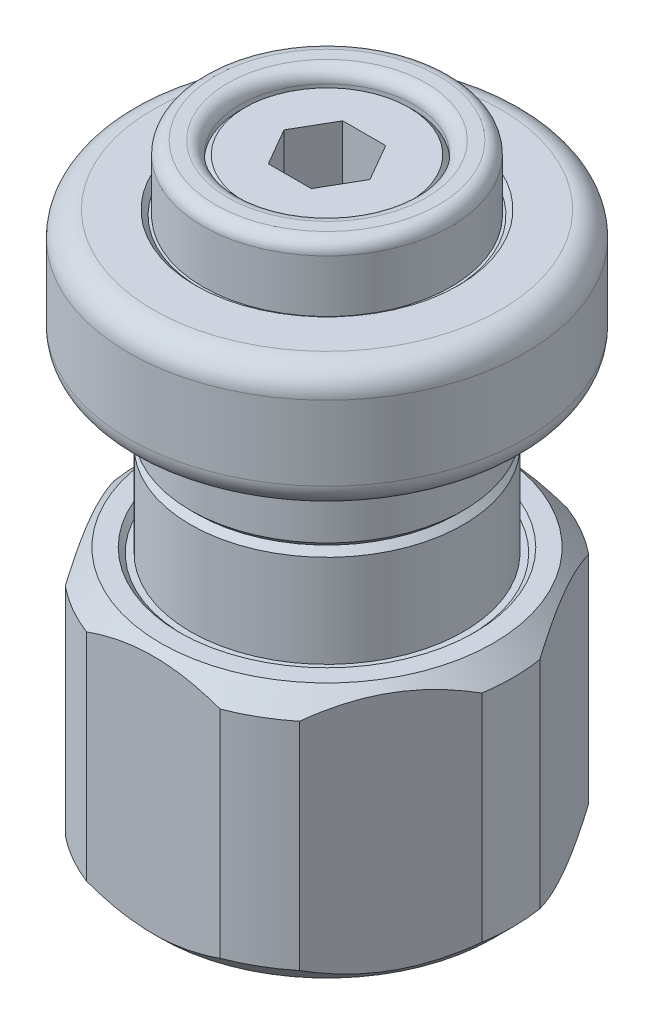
ISO-10303-21;
HEADER;
FILE_DESCRIPTION(('STEP AP214'),'2;1');
FILE_NAME('part.step','',(''),(''),'','','');
FILE_SCHEMA(('AUTOMOTIVE_DESIGN { 1 0 10303 214 1 1 1 1 }'));
ENDSEC;
DATA;
#1=APPLICATION_CONTEXT('core data for automotive mechanical design processes');
#2=APPLICATION_PROTOCOL_DEFINITION('international standard','automotive_design',2000,#1);
#3=PRODUCT_CONTEXT('',#1,'mechanical');
#4=PRODUCT('Part','Part','',(#3));
#5=PRODUCT_RELATED_PRODUCT_CATEGORY('part','',(#4));
#6=PRODUCT_DEFINITION_FORMATION('','',#4);
#7=PRODUCT_DEFINITION_CONTEXT('part definition',#1,'design');
#8=PRODUCT_DEFINITION('design','',#6,#7);
#9=PRODUCT_DEFINITION_SHAPE('','',#8);
#10=(LENGTH_UNIT() NAMED_UNIT(*) SI_UNIT(.MILLI.,.METRE.));
#11=(NAMED_UNIT(*) PLANE_ANGLE_UNIT() SI_UNIT($,.RADIAN.));
#12=(NAMED_UNIT(*) SI_UNIT($,.STERADIAN.) SOLID_ANGLE_UNIT());
#13=UNCERTAINTY_MEASURE_WITH_UNIT(LENGTH_MEASURE(1.E-05),#10,'distance_accuracy_value','');
#14=(GEOMETRIC_REPRESENTATION_CONTEXT(3) GLOBAL_UNCERTAINTY_ASSIGNED_CONTEXT((#13)) GLOBAL_UNIT_ASSIGNED_CONTEXT((#10,
#11,#12)) REPRESENTATION_CONTEXT('',''));
#15=CARTESIAN_POINT('',(0.,0.,0.));
#16=DIRECTION('',(0.,0.,1.));
#17=DIRECTION('',(1.,0.,0.));
#18=AXIS2_PLACEMENT_3D('',#15,#16,#17);
#19=CARTESIAN_POINT('',(0.,16.,0.));
#20=DIRECTION('',(0.,1.,0.));
#21=DIRECTION('',(0.,0.,1.));
#22=AXIS2_PLACEMENT_3D('',#19,#20,#21);
#23=CONICAL_SURFACE('',#22,2.1,0.407150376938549);
#24=CARTESIAN_POINT('',(0.,16.,0.));
#25=DIRECTION('',(0.,-1.,0.));
#26=DIRECTION('',(0.,0.,-1.));
#27=AXIS2_PLACEMENT_3D('',#24,#25,#26);
#28=CIRCLE('',#27,2.1);
#29=CARTESIAN_POINT('',(0.,16.,-2.1));
#30=VERTEX_POINT('',#29);
#31=EDGE_CURVE('E736',#30,#30,#28,.T.);
#32=ORIENTED_EDGE('',*,*,#31,.F.);
#33=EDGE_LOOP('',(#32));
#34=FACE_BOUND('',#33,.T.);
#35=CARTESIAN_POINT('',(0.,15.7681145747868,0.));
#36=DIRECTION('',(0.,-1.,0.));
#37=DIRECTION('',(0.,0.,-1.));
#38=AXIS2_PLACEMENT_3D('',#35,#36,#37);
#39=CIRCLE('',#38,2.);
#40=CARTESIAN_POINT('',(1.9710477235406,15.7681145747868,0.33907354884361));
#41=VERTEX_POINT('',#40);
#42=CARTESIAN_POINT('',(0.339073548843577,15.7681145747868,1.97104772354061));
#43=VERTEX_POINT('',#42);
#44=EDGE_CURVE('E234',#41,#43,#39,.T.);
#45=ORIENTED_EDGE('',*,*,#44,.T.);
#46=CARTESIAN_POINT('',(0.339318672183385,15.7679145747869,1.97091802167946));
#47=CARTESIAN_POINT('',(0.319129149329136,15.7844325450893,1.98163094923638));
#48=CARTESIAN_POINT('',(0.297359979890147,15.7995528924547,1.99162799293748));
#49=CARTESIAN_POINT('',(0.251108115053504,15.8265799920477,2.00972826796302));
#50=CARTESIAN_POINT('',(0.22661758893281,15.8384771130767,2.01782581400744));
#51=CARTESIAN_POINT('',(0.175409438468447,15.8585695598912,2.03161873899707));
#52=CARTESIAN_POINT('',(0.14868469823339,15.8667524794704,2.03730606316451));
#53=CARTESIAN_POINT('',(0.0939111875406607,15.8789842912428,2.04584312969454));
#54=CARTESIAN_POINT('',(0.0658648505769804,15.8830404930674,2.04869788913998));
#55=CARTESIAN_POINT('',(0.0112083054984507,15.8867228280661,2.05128917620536));
#56=CARTESIAN_POINT('',(-0.0153745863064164,15.8866235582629,2.05121898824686));
#57=CARTESIAN_POINT('',(-0.0681276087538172,15.8826757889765,2.04844164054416));
#58=CARTESIAN_POINT('',(-0.0942976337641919,15.878826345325,2.04573381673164));
#59=CARTESIAN_POINT('',(-0.144843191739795,15.8676765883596,2.0379501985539));
#60=CARTESIAN_POINT('',(-0.169246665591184,15.8604609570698,2.03293255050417));
#61=CARTESIAN_POINT('',(-0.21634705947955,15.8428755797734,2.02083457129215));
#62=CARTESIAN_POINT('',(-0.239043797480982,15.8325054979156,2.01375402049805));
#63=CARTESIAN_POINT('',(-0.274759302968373,15.8130483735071,2.00065214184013));
#64=CARTESIAN_POINT('',(-0.288405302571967,15.8047629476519,1.99511463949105));
#65=CARTESIAN_POINT('',(-0.314651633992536,15.7871201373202,1.98344079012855));
#66=CARTESIAN_POINT('',(-0.327254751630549,15.7777657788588,1.97730614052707));
#67=CARTESIAN_POINT('',(-0.339318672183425,15.7679145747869,1.97091802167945));
#68=B_SPLINE_CURVE_WITH_KNOTS('',3,(#46,#47,#48,#49,#50,#51,#52,#53,#54,#55,#56,#57,#58,#59,#60,
#61,#62,#63,#64,#65,#66,#67),.UNSPECIFIED.,.F.,.F.,(4,2,2,2,2,2,2,2,2,2,4),(0.,
0.0845773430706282,0.169404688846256,0.254513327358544,0.339470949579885,0.418823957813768,
0.498196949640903,0.575672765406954,0.653156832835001,0.70377778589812,0.754258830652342),.UNSPECIFIED.);
#69=CARTESIAN_POINT('',(-0.339073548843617,15.7681145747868,1.9710477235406));
#70=VERTEX_POINT('',#69);
#71=EDGE_CURVE('E208',#43,#70,#68,.T.);
#72=ORIENTED_EDGE('',*,*,#71,.T.);
#73=CARTESIAN_POINT('',(-1.9710477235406,15.7681145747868,0.339073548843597));
#74=VERTEX_POINT('',#73);
#75=EDGE_CURVE('E206',#70,#74,#39,.T.);
#76=ORIENTED_EDGE('',*,*,#75,.T.);
#77=CARTESIAN_POINT('',(-1.97091802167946,15.7679145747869,0.339318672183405));
#78=CARTESIAN_POINT('',(-1.98163094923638,15.7844325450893,0.319129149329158));
#79=CARTESIAN_POINT('',(-1.99162799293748,15.7995528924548,0.297359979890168));
#80=CARTESIAN_POINT('',(-2.00972826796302,15.8265799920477,0.251108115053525));
#81=CARTESIAN_POINT('',(-2.01782581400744,15.8384771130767,0.226617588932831));
#82=CARTESIAN_POINT('',(-2.03161873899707,15.8585695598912,0.175409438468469));
#83=CARTESIAN_POINT('',(-2.03730606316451,15.8667524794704,0.148684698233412));
#84=CARTESIAN_POINT('',(-2.04584312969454,15.8789842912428,0.0939111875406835));
#85=CARTESIAN_POINT('',(-2.04869788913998,15.8830404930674,0.0658648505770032));
#86=CARTESIAN_POINT('',(-2.05128917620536,15.8867228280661,0.0112083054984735));
#87=CARTESIAN_POINT('',(-2.05121898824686,15.8866235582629,-0.0153745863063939));
#88=CARTESIAN_POINT('',(-2.04844164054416,15.8826757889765,-0.0681276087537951));
#89=CARTESIAN_POINT('',(-2.04573381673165,15.878826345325,-0.0942976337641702));
#90=CARTESIAN_POINT('',(-2.0379501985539,15.8676765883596,-0.144843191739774));
#91=CARTESIAN_POINT('',(-2.03293255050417,15.8604609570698,-0.169246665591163));
#92=CARTESIAN_POINT('',(-2.02083457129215,15.8428755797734,-0.216347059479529));
#93=CARTESIAN_POINT('',(-2.01375402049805,15.8325054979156,-0.239043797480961));
#94=CARTESIAN_POINT('',(-2.00065214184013,15.8130483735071,-0.274759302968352));
#95=CARTESIAN_POINT('',(-1.99511463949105,15.8047629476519,-0.288405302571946));
#96=CARTESIAN_POINT('',(-1.98344079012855,15.7871201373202,-0.314651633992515));
#97=CARTESIAN_POINT('',(-1.97730614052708,15.7777657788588,-0.327254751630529));
#98=CARTESIAN_POINT('',(-1.97091802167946,15.7679145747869,-0.339318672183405));
#99=B_SPLINE_CURVE_WITH_KNOTS('',3,(#77,#78,#79,#80,#81,#82,#83,#84,#85,#86,#87,#88,#89,#90,#91,
#92,#93,#94,#95,#96,#97,#98),.UNSPECIFIED.,.F.,.F.,(4,2,2,2,2,2,2,2,2,2,4),(0.,
0.0845773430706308,0.169404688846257,0.254513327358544,0.339470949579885,0.418823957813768,
0.498196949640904,0.575672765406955,0.653156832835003,0.703777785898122,0.754258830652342),.UNSPECIFIED.);
#100=CARTESIAN_POINT('',(-1.9710477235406,15.7681145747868,-0.339073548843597));
#101=VERTEX_POINT('',#100);
#102=EDGE_CURVE('E440',#74,#101,#99,.T.);
#103=ORIENTED_EDGE('',*,*,#102,.T.);
#104=CARTESIAN_POINT('',(-0.339073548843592,15.7681145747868,-1.97104772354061));
#105=VERTEX_POINT('',#104);
#106=EDGE_CURVE('E235',#101,#105,#39,.T.);
#107=ORIENTED_EDGE('',*,*,#106,.T.);
#108=CARTESIAN_POINT('',(-0.339318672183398,15.7679145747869,-1.97091802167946));
#109=CARTESIAN_POINT('',(-0.319129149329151,15.7844325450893,-1.98163094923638));
#110=CARTESIAN_POINT('',(-0.297359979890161,15.7995528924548,-1.99162799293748));
#111=CARTESIAN_POINT('',(-0.251108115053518,15.8265799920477,-2.00972826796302));
#112=CARTESIAN_POINT('',(-0.226617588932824,15.8384771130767,-2.01782581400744));
#113=CARTESIAN_POINT('',(-0.175409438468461,15.8585695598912,-2.03161873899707));
#114=CARTESIAN_POINT('',(-0.148684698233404,15.8667524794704,-2.03730606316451));
#115=CARTESIAN_POINT('',(-0.0939111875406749,15.8789842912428,-2.04584312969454));
#116=CARTESIAN_POINT('',(-0.0658648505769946,15.8830404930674,-2.04869788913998));
#117=CARTESIAN_POINT('',(-0.011208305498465,15.8867228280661,-2.05128917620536));
#118=CARTESIAN_POINT('',(0.0153745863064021,15.8866235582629,-2.05121898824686));
#119=CARTESIAN_POINT('',(0.0681276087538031,15.8826757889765,-2.04844164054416));
#120=CARTESIAN_POINT('',(0.094297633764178,15.878826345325,-2.04573381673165));
#121=CARTESIAN_POINT('',(0.144843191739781,15.8676765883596,-2.0379501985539));
#122=CARTESIAN_POINT('',(0.16924666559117,15.8604609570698,-2.03293255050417));
#123=CARTESIAN_POINT('',(0.216347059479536,15.8428755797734,-2.02083457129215));
#124=CARTESIAN_POINT('',(0.239043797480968,15.8325054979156,-2.01375402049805));
#125=CARTESIAN_POINT('',(0.27475930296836,15.8130483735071,-2.00065214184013));
#126=CARTESIAN_POINT('',(0.288405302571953,15.8047629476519,-1.99511463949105));
#127=CARTESIAN_POINT('',(0.314651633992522,15.7871201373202,-1.98344079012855));
#128=CARTESIAN_POINT('',(0.327254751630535,15.7777657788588,-1.97730614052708));
#129=CARTESIAN_POINT('',(0.339318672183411,15.7679145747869,-1.97091802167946));
#130=B_SPLINE_CURVE_WITH_KNOTS('',3,(#108,#109,#110,#111,#112,#113,#114,#115,#116,#117,#118,
#119,#120,#121,#122,#123,#124,#125,#126,#127,#128,#129),.UNSPECIFIED.,.F.,.F.,(4,2,2,2,2,2,2,2,
2,2,4),(0.,0.0845773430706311,0.169404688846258,0.254513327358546,0.339470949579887,
0.418823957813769,0.498196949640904,0.575672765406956,0.653156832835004,0.703777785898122,
0.754258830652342),.UNSPECIFIED.);
#131=CARTESIAN_POINT('',(0.339073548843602,15.7681145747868,-1.9710477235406));
#132=VERTEX_POINT('',#131);
#133=EDGE_CURVE('E359',#105,#132,#130,.T.);
#134=ORIENTED_EDGE('',*,*,#133,.T.);
#135=CARTESIAN_POINT('',(1.97104772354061,15.7681145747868,-0.339073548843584));
#136=VERTEX_POINT('',#135);
#137=EDGE_CURVE('E740',#132,#136,#39,.T.);
#138=ORIENTED_EDGE('',*,*,#137,.T.);
#139=CARTESIAN_POINT('',(1.97091802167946,15.7679145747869,-0.339318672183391));
#140=CARTESIAN_POINT('',(1.98163094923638,15.7844325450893,-0.319129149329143));
#141=CARTESIAN_POINT('',(1.99162799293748,15.7995528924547,-0.297359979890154));
#142=CARTESIAN_POINT('',(2.00972826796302,15.8265799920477,-0.251108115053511));
#143=CARTESIAN_POINT('',(2.01782581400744,15.8384771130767,-0.226617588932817));
#144=CARTESIAN_POINT('',(2.03161873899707,15.8585695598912,-0.175409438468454));
#145=CARTESIAN_POINT('',(2.03730606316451,15.8667524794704,-0.148684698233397));
#146=CARTESIAN_POINT('',(2.04584312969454,15.8789842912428,-0.0939111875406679));
#147=CARTESIAN_POINT('',(2.04869788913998,15.8830404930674,-0.0658648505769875));
#148=CARTESIAN_POINT('',(2.05128917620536,15.8867228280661,-0.0112083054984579));
#149=CARTESIAN_POINT('',(2.05121898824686,15.8866235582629,0.0153745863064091));
#150=CARTESIAN_POINT('',(2.04844164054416,15.8826757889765,0.0681276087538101));
#151=CARTESIAN_POINT('',(2.04573381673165,15.878826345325,0.0942976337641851));
#152=CARTESIAN_POINT('',(2.0379501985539,15.8676765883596,0.144843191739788));
#153=CARTESIAN_POINT('',(2.03293255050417,15.8604609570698,0.169246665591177));
#154=CARTESIAN_POINT('',(2.02083457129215,15.8428755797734,0.216347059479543));
#155=CARTESIAN_POINT('',(2.01375402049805,15.8325054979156,0.239043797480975));
#156=CARTESIAN_POINT('',(2.00065214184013,15.8130483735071,0.274759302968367));
#157=CARTESIAN_POINT('',(1.99511463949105,15.8047629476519,0.28840530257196));
#158=CARTESIAN_POINT('',(1.98344079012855,15.7871201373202,0.314651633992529));
#159=CARTESIAN_POINT('',(1.97730614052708,15.7777657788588,0.327254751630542));
#160=CARTESIAN_POINT('',(1.97091802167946,15.7679145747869,0.339318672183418));
#161=B_SPLINE_CURVE_WITH_KNOTS('',3,(#139,#140,#141,#142,#143,#144,#145,#146,#147,#148,#149,
#150,#151,#152,#153,#154,#155,#156,#157,#158,#159,#160),.UNSPECIFIED.,.F.,.F.,(4,2,2,2,2,2,2,2,
2,2,4),(0.,0.0845773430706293,0.169404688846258,0.254513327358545,0.339470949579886,
0.418823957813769,0.498196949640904,0.575672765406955,0.653156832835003,0.703777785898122,
0.754258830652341),.UNSPECIFIED.);
#162=EDGE_CURVE('E288',#136,#41,#161,.T.);
#163=ORIENTED_EDGE('',*,*,#162,.T.);
#164=EDGE_LOOP('',(#45,#72,#76,#103,#107,#134,#138,#163));
#165=FACE_BOUND('',#164,.T.);
#166=ADVANCED_FACE('F16',(#34,#165),#23,.F.);
#167=CARTESIAN_POINT('',(0.,0.,0.));
#168=DIRECTION('',(0.,-1.,0.));
#169=DIRECTION('',(0.,0.,-1.));
#170=AXIS2_PLACEMENT_3D('',#167,#168,#169);
#171=CYLINDRICAL_SURFACE('',#170,2.);
#172=ORIENTED_EDGE('',*,*,#75,.F.);
#173=CARTESIAN_POINT('',(-0.338718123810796,15.7683145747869,1.9711088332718));
#174=CARTESIAN_POINT('',(-0.378277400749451,15.7461106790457,1.96431792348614));
#175=CARTESIAN_POINT('',(-0.415456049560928,15.7201974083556,1.95669573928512));
#176=CARTESIAN_POINT('',(-0.484300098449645,15.6623449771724,1.94079563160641));
#177=CARTESIAN_POINT('',(-0.515993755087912,15.6304385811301,1.93252140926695));
#178=CARTESIAN_POINT('',(-0.573465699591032,15.5618288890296,1.91625476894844));
#179=CARTESIAN_POINT('',(-0.599260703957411,15.5251396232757,1.90826161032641));
#180=CARTESIAN_POINT('',(-0.644887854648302,15.4479829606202,1.89332942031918));
#181=CARTESIAN_POINT('',(-0.664712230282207,15.4075107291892,1.88639176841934));
#182=CARTESIAN_POINT('',(-0.699401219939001,15.3210733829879,1.87382049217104));
#183=CARTESIAN_POINT('',(-0.713844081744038,15.2749219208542,1.86830551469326));
#184=CARTESIAN_POINT('',(-0.735785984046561,15.1807833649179,1.85977343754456));
#185=CARTESIAN_POINT('',(-0.743284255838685,15.1327960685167,1.85675661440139));
#186=CARTESIAN_POINT('',(-0.751641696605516,15.0325781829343,1.85339120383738));
#187=CARTESIAN_POINT('',(-0.751971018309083,14.9802954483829,1.8532555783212));
#188=CARTESIAN_POINT('',(-0.744630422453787,14.876379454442,1.85621663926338));
#189=CARTESIAN_POINT('',(-0.7369590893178,14.8247463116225,1.85931389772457));
#190=CARTESIAN_POINT('',(-0.713421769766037,14.722781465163,1.86847303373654));
#191=CARTESIAN_POINT('',(-0.697429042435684,14.6724829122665,1.87458068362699));
#192=CARTESIAN_POINT('',(-0.657174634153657,14.5755971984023,1.88906766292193));
#193=CARTESIAN_POINT('',(-0.632908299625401,14.5290121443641,1.89744827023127));
#194=CARTESIAN_POINT('',(-0.577406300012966,14.4430487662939,1.91504959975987));
#195=CARTESIAN_POINT('',(-0.546486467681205,14.4034574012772,1.92422360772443));
#196=CARTESIAN_POINT('',(-0.477623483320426,14.3310237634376,1.94245441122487));
#197=CARTESIAN_POINT('',(-0.439706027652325,14.2981576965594,1.95151150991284));
#198=CARTESIAN_POINT('',(-0.389111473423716,14.2627173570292,1.96180808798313));
#199=CARTESIAN_POINT('',(-0.379253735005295,14.2561661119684,1.96373902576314));
#200=CARTESIAN_POINT('',(-0.359222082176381,14.2435554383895,1.96750167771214));
#201=CARTESIAN_POINT('',(-0.349048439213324,14.237495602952,1.9693334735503));
#202=CARTESIAN_POINT('',(-0.338718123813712,14.2316854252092,1.97110883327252));
#203=B_SPLINE_CURVE_WITH_KNOTS('',3,(#173,#174,#175,#176,#177,#178,#179,#180,#181,#182,#183,
#184,#185,#186,#187,#188,#189,#190,#191,#192,#193,#194,#195,#196,#197,#198,#199,#200,#201,#202),
.UNSPECIFIED.,.F.,.F.,(4,2,2,2,2,2,2,2,2,2,2,2,2,2,4),(0.,0.137206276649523,0.273683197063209,
0.409768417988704,0.546029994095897,0.691429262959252,0.836844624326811,0.992973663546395,
1.14913033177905,1.30773818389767,1.46643539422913,1.61881619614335,1.77064818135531,
1.80661660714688,1.84255493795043),.UNSPECIFIED.);
#204=CARTESIAN_POINT('',(-0.339073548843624,14.2318854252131,1.9710477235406));
#205=VERTEX_POINT('',#204);
#206=EDGE_CURVE('E194',#70,#205,#203,.T.);
#207=ORIENTED_EDGE('',*,*,#206,.T.);
#208=CARTESIAN_POINT('',(0.,14.2318854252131,0.));
#209=DIRECTION('',(0.,-1.,0.));
#210=DIRECTION('',(0.,0.,-1.));
#211=AXIS2_PLACEMENT_3D('',#208,#209,#210);
#212=CIRCLE('',#211,2.);
#213=CARTESIAN_POINT('',(-1.9710477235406,14.2318854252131,0.339073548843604));
#214=VERTEX_POINT('',#213);
#215=EDGE_CURVE('E204',#205,#214,#212,.T.);
#216=ORIENTED_EDGE('',*,*,#215,.T.);
#217=CARTESIAN_POINT('',(-1.97110883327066,14.2316854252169,0.338718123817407));
#218=CARTESIAN_POINT('',(-1.96431792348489,14.2538893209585,0.378277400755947));
#219=CARTESIAN_POINT('',(-1.95669573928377,14.2798025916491,0.415456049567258));
#220=CARTESIAN_POINT('',(-1.94079563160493,14.3376550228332,0.48430009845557));
#221=CARTESIAN_POINT('',(-1.93252140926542,14.369561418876,0.515993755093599));
#222=CARTESIAN_POINT('',(-1.91625476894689,14.4381711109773,0.573465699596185));
#223=CARTESIAN_POINT('',(-1.90826161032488,14.4748603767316,0.599260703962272));
#224=CARTESIAN_POINT('',(-1.89332942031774,14.5520170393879,0.644887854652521));
#225=CARTESIAN_POINT('',(-1.88639176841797,14.5924892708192,0.664712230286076));
#226=CARTESIAN_POINT('',(-1.87382049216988,14.6789266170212,0.699401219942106));
#227=CARTESIAN_POINT('',(-1.86830551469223,14.7250780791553,0.713844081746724));
#228=CARTESIAN_POINT('',(-1.85977343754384,14.8192166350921,0.735785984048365));
#229=CARTESIAN_POINT('',(-1.85675661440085,14.8672039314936,0.743284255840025));
#230=CARTESIAN_POINT('',(-1.85339120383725,14.9674218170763,0.751641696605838));
#231=CARTESIAN_POINT('',(-1.85325557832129,15.0197045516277,0.751971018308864));
#232=CARTESIAN_POINT('',(-1.85621663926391,15.1236205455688,0.744630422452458));
#233=CARTESIAN_POINT('',(-1.85931389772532,15.1752536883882,0.736959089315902));
#234=CARTESIAN_POINT('',(-1.86847303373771,15.2772185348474,0.713421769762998));
#235=CARTESIAN_POINT('',(-1.87458068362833,15.3275170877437,0.697429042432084));
#236=CARTESIAN_POINT('',(-1.88906766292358,15.4244028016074,0.657174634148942));
#237=CARTESIAN_POINT('',(-1.89744827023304,15.4709878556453,0.632908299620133));
#238=CARTESIAN_POINT('',(-1.91504959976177,15.5569512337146,0.577406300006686));
#239=CARTESIAN_POINT('',(-1.92422360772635,15.5965425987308,0.546486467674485));
#240=CARTESIAN_POINT('',(-1.94245441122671,15.6689762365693,0.477623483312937));
#241=CARTESIAN_POINT('',(-1.95151150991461,15.7018423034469,0.439706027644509));
#242=CARTESIAN_POINT('',(-1.96180808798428,15.7372826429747,0.389111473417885));
#243=CARTESIAN_POINT('',(-1.96373902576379,15.7438338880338,0.379253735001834));
#244=CARTESIAN_POINT('',(-1.96750167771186,15.7564445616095,0.359222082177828));
#245=CARTESIAN_POINT('',(-1.96933347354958,15.7625043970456,0.349048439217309));
#246=CARTESIAN_POINT('',(-1.97110883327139,15.7683145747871,0.33871812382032));
#247=B_SPLINE_CURVE_WITH_KNOTS('',3,(#217,#218,#219,#220,#221,#222,#223,#224,#225,#226,#227,
#228,#229,#230,#231,#232,#233,#234,#235,#236,#237,#238,#239,#240,#241,#242,#243,#244,#245,#246),
.UNSPECIFIED.,.F.,.F.,(4,2,2,2,2,2,2,2,2,2,2,2,2,2,4),(0.,0.137206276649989,0.273683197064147,
0.4097684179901,0.546029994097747,0.691429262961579,0.836844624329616,0.992973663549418,
1.14913033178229,1.30773818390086,1.46643539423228,1.61881619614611,1.77064818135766,
1.80661660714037,1.84255493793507),.UNSPECIFIED.);
#248=EDGE_CURVE('E304',#214,#74,#247,.T.);
#249=ORIENTED_EDGE('',*,*,#248,.T.);
#250=EDGE_LOOP('',(#172,#207,#216,#249));
#251=FACE_BOUND('',#250,.T.);
#252=ADVANCED_FACE('F202',(#251),#171,.F.);
#253=CARTESIAN_POINT('',(1.9710477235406,14.2318854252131,0.339073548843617));
#254=VERTEX_POINT('',#253);
#255=CARTESIAN_POINT('',(0.339073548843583,14.2318854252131,1.97104772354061));
#256=VERTEX_POINT('',#255);
#257=EDGE_CURVE('E215',#254,#256,#212,.T.);
#258=ORIENTED_EDGE('',*,*,#257,.T.);
#259=CARTESIAN_POINT('',(0.338718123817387,14.2316854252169,1.97110883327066));
#260=CARTESIAN_POINT('',(0.378277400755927,14.2538893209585,1.96431792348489));
#261=CARTESIAN_POINT('',(0.415456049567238,14.2798025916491,1.95669573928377));
#262=CARTESIAN_POINT('',(0.484300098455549,14.3376550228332,1.94079563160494));
#263=CARTESIAN_POINT('',(0.515993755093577,14.369561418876,1.93252140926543));
#264=CARTESIAN_POINT('',(0.573465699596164,14.4381711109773,1.9162547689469));
#265=CARTESIAN_POINT('',(0.599260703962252,14.4748603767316,1.90826161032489));
#266=CARTESIAN_POINT('',(0.644887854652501,14.5520170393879,1.89332942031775));
#267=CARTESIAN_POINT('',(0.664712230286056,14.5924892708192,1.88639176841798));
#268=CARTESIAN_POINT('',(0.699401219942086,14.6789266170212,1.87382049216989));
#269=CARTESIAN_POINT('',(0.713844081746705,14.7250780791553,1.86830551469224));
#270=CARTESIAN_POINT('',(0.735785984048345,14.8192166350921,1.85977343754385));
#271=CARTESIAN_POINT('',(0.743284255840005,14.8672039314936,1.85675661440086));
#272=CARTESIAN_POINT('',(0.751641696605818,14.9674218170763,1.85339120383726));
#273=CARTESIAN_POINT('',(0.751971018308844,15.0197045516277,1.8532555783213));
#274=CARTESIAN_POINT('',(0.744630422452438,15.1236205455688,1.85621663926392));
#275=CARTESIAN_POINT('',(0.736959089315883,15.1752536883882,1.85931389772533));
#276=CARTESIAN_POINT('',(0.713421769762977,15.2772185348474,1.86847303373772));
#277=CARTESIAN_POINT('',(0.697429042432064,15.3275170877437,1.87458068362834));
#278=CARTESIAN_POINT('',(0.657174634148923,15.4244028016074,1.88906766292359));
#279=CARTESIAN_POINT('',(0.632908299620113,15.4709878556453,1.89744827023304));
#280=CARTESIAN_POINT('',(0.577406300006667,15.5569512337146,1.91504959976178));
#281=CARTESIAN_POINT('',(0.546486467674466,15.5965425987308,1.92422360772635));
#282=CARTESIAN_POINT('',(0.477623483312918,15.6689762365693,1.94245441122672));
#283=CARTESIAN_POINT('',(0.439706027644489,15.7018423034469,1.95151150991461));
#284=CARTESIAN_POINT('',(0.389111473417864,15.7372826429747,1.96180808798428));
#285=CARTESIAN_POINT('',(0.379253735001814,15.7438338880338,1.9637390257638));
#286=CARTESIAN_POINT('',(0.359222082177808,15.7564445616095,1.96750167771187));
#287=CARTESIAN_POINT('',(0.349048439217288,15.7625043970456,1.96933347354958));
#288=CARTESIAN_POINT('',(0.338718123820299,15.7683145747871,1.97110883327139));
#289=B_SPLINE_CURVE_WITH_KNOTS('',3,(#259,#260,#261,#262,#263,#264,#265,#266,#267,#268,#269,
#270,#271,#272,#273,#274,#275,#276,#277,#278,#279,#280,#281,#282,#283,#284,#285,#286,#287,#288),
.UNSPECIFIED.,.F.,.F.,(4,2,2,2,2,2,2,2,2,2,2,2,2,2,4),(0.,0.137206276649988,0.273683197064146,
0.409768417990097,0.546029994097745,0.691429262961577,0.836844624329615,0.992973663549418,
1.14913033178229,1.30773818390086,1.46643539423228,1.61881619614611,1.77064818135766,
1.80661660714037,1.84255493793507),.UNSPECIFIED.);
#290=EDGE_CURVE('E38',#256,#43,#289,.T.);
#291=ORIENTED_EDGE('',*,*,#290,.T.);
#292=ORIENTED_EDGE('',*,*,#44,.F.);
#293=CARTESIAN_POINT('',(1.97110883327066,15.7683145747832,0.338718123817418));
#294=CARTESIAN_POINT('',(1.96431792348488,15.7461106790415,0.378277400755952));
#295=CARTESIAN_POINT('',(1.95669573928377,15.7201974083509,0.415456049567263));
#296=CARTESIAN_POINT('',(1.94079563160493,15.6623449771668,0.484300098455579));
#297=CARTESIAN_POINT('',(1.93252140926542,15.630438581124,0.515993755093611));
#298=CARTESIAN_POINT('',(1.91625476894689,15.5618288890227,0.573465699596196));
#299=CARTESIAN_POINT('',(1.90826161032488,15.5251396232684,0.599260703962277));
#300=CARTESIAN_POINT('',(1.89332942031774,15.4479829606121,0.644887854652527));
#301=CARTESIAN_POINT('',(1.88639176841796,15.4075107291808,0.664712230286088));
#302=CARTESIAN_POINT('',(1.87382049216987,15.3210733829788,0.69940121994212));
#303=CARTESIAN_POINT('',(1.86830551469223,15.2749219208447,0.713844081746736));
#304=CARTESIAN_POINT('',(1.85977343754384,15.1807833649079,0.735785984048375));
#305=CARTESIAN_POINT('',(1.85675661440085,15.1327960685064,0.743284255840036));
#306=CARTESIAN_POINT('',(1.85339120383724,15.0325781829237,0.751641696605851));
#307=CARTESIAN_POINT('',(1.85325557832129,14.9802954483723,0.751971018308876));
#308=CARTESIAN_POINT('',(1.85621663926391,14.8763794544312,0.744630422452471));
#309=CARTESIAN_POINT('',(1.85931389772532,14.8247463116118,0.736959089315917));
#310=CARTESIAN_POINT('',(1.8684730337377,14.7227814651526,0.713421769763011));
#311=CARTESIAN_POINT('',(1.87458068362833,14.6724829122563,0.697429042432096));
#312=CARTESIAN_POINT('',(1.88906766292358,14.5755971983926,0.657174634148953));
#313=CARTESIAN_POINT('',(1.89744827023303,14.5290121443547,0.632908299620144));
#314=CARTESIAN_POINT('',(1.91504959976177,14.4430487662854,0.577406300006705));
#315=CARTESIAN_POINT('',(1.92422360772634,14.4034574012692,0.546486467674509));
#316=CARTESIAN_POINT('',(1.94245441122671,14.3310237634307,0.477623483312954));
#317=CARTESIAN_POINT('',(1.95151150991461,14.2981576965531,0.439706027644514));
#318=CARTESIAN_POINT('',(1.96180808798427,14.2627173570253,0.389111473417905));
#319=CARTESIAN_POINT('',(1.96373902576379,14.2561661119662,0.379253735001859));
#320=CARTESIAN_POINT('',(1.96750167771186,14.2435554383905,0.359222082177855));
#321=CARTESIAN_POINT('',(1.96933347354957,14.2374956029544,0.349048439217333));
#322=CARTESIAN_POINT('',(1.97110883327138,14.2316854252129,0.338718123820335));
#323=B_SPLINE_CURVE_WITH_KNOTS('',3,(#293,#294,#295,#296,#297,#298,#299,#300,#301,#302,#303,
#304,#305,#306,#307,#308,#309,#310,#311,#312,#313,#314,#315,#316,#317,#318,#319,#320,#321,#322),
.UNSPECIFIED.,.F.,.F.,(4,2,2,2,2,2,2,2,2,2,2,2,2,2,4),(0.,0.137206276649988,0.273683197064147,
0.409768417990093,0.546029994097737,0.691429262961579,0.836844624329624,0.992973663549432,
1.14913033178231,1.30773818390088,1.46643539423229,1.61881619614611,1.77064818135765,
1.80661660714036,1.84255493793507),.UNSPECIFIED.);
#324=EDGE_CURVE('E282',#41,#254,#323,.T.);
#325=ORIENTED_EDGE('',*,*,#324,.T.);
#326=EDGE_LOOP('',(#258,#291,#292,#325));
#327=FACE_BOUND('',#326,.T.);
#328=ADVANCED_FACE('F297',(#327),#171,.F.);
#329=CARTESIAN_POINT('',(0.,14.2318854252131,0.));
#330=DIRECTION('',(0.,-1.,0.));
#331=DIRECTION('',(0.,0.,-1.));
#332=AXIS2_PLACEMENT_3D('',#329,#330,#331);
#333=CONICAL_SURFACE('',#332,2.,0.407150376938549);
#334=CARTESIAN_POINT('',(0.,14.,0.));
#335=DIRECTION('',(0.,-1.,0.));
#336=DIRECTION('',(0.,0.,-1.));
#337=AXIS2_PLACEMENT_3D('',#334,#335,#336);
#338=CIRCLE('',#337,2.1);
#339=CARTESIAN_POINT('',(0.,14.,-2.1));
#340=VERTEX_POINT('',#339);
#341=EDGE_CURVE('E216',#340,#340,#338,.T.);
#342=ORIENTED_EDGE('',*,*,#341,.T.);
#343=EDGE_LOOP('',(#342));
#344=FACE_BOUND('',#343,.T.);
#345=ORIENTED_EDGE('',*,*,#215,.F.);
#346=CARTESIAN_POINT('',(-0.339318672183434,14.2320854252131,1.97091802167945));
#347=CARTESIAN_POINT('',(-0.319129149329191,14.2155674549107,1.98163094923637));
#348=CARTESIAN_POINT('',(-0.297359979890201,14.2004471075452,1.99162799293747));
#349=CARTESIAN_POINT('',(-0.251108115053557,14.1734200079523,2.00972826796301));
#350=CARTESIAN_POINT('',(-0.226617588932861,14.1615228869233,2.01782581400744));
#351=CARTESIAN_POINT('',(-0.175409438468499,14.1414304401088,2.03161873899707));
#352=CARTESIAN_POINT('',(-0.148684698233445,14.1332475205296,2.03730606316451));
#353=CARTESIAN_POINT('',(-0.0939111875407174,14.1210157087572,2.04584312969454));
#354=CARTESIAN_POINT('',(-0.0658648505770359,14.1169595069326,2.04869788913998));
#355=CARTESIAN_POINT('',(-0.0112083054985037,14.1132771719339,2.05128917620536));
#356=CARTESIAN_POINT('',(0.0153745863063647,14.113376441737,2.05121898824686));
#357=CARTESIAN_POINT('',(0.0681276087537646,14.1173242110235,2.04844164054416));
#358=CARTESIAN_POINT('',(0.0942976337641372,14.121173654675,2.04573381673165));
#359=CARTESIAN_POINT('',(0.144843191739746,14.1323234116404,2.03795019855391));
#360=CARTESIAN_POINT('',(0.169246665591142,14.1395390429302,2.03293255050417));
#361=CARTESIAN_POINT('',(0.216347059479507,14.1571244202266,2.02083457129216));
#362=CARTESIAN_POINT('',(0.239043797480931,14.1674945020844,2.01375402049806));
#363=CARTESIAN_POINT('',(0.274759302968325,14.1869516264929,2.00065214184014));
#364=CARTESIAN_POINT('',(0.288405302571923,14.1952370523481,1.99511463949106));
#365=CARTESIAN_POINT('',(0.314651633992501,14.2128798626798,1.98344079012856));
#366=CARTESIAN_POINT('',(0.327254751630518,14.2222342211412,1.97730614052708));
#367=CARTESIAN_POINT('',(0.339318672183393,14.2320854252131,1.97091802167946));
#368=B_SPLINE_CURVE_WITH_KNOTS('',3,(#346,#347,#348,#349,#350,#351,#352,#353,#354,#355,#356,
#357,#358,#359,#360,#361,#362,#363,#364,#365,#366,#367),.UNSPECIFIED.,.F.,.F.,(4,2,2,2,2,2,2,2,
2,2,4),(0.,0.0845773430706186,0.169404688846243,0.254513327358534,0.339470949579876,
0.418823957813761,0.498196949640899,0.575672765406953,0.653156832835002,0.70377778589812,
0.754258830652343),.UNSPECIFIED.);
#369=EDGE_CURVE('E10',#205,#256,#368,.T.);
#370=ORIENTED_EDGE('',*,*,#369,.T.);
#371=ORIENTED_EDGE('',*,*,#257,.F.);
#372=CARTESIAN_POINT('',(1.97091802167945,14.2320854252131,0.339318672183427));
#373=CARTESIAN_POINT('',(1.98163094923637,14.2155674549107,0.319129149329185));
#374=CARTESIAN_POINT('',(1.99162799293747,14.2004471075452,0.297359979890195));
#375=CARTESIAN_POINT('',(2.00972826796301,14.1734200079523,0.25110811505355));
#376=CARTESIAN_POINT('',(2.01782581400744,14.1615228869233,0.226617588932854));
#377=CARTESIAN_POINT('',(2.03161873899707,14.1414304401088,0.175409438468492));
#378=CARTESIAN_POINT('',(2.03730606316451,14.1332475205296,0.148684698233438));
#379=CARTESIAN_POINT('',(2.04584312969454,14.1210157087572,0.0939111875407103));
#380=CARTESIAN_POINT('',(2.04869788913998,14.1169595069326,0.0658648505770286));
#381=CARTESIAN_POINT('',(2.05128917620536,14.1132771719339,0.0112083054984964));
#382=CARTESIAN_POINT('',(2.05121898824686,14.113376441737,-0.015374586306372));
#383=CARTESIAN_POINT('',(2.04844164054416,14.1173242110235,-0.0681276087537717));
#384=CARTESIAN_POINT('',(2.04573381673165,14.121173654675,-0.094297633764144));
#385=CARTESIAN_POINT('',(2.03795019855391,14.1323234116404,-0.144843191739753));
#386=CARTESIAN_POINT('',(2.03293255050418,14.1395390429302,-0.16924666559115));
#387=CARTESIAN_POINT('',(2.02083457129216,14.1571244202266,-0.216347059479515));
#388=CARTESIAN_POINT('',(2.01375402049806,14.1674945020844,-0.239043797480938));
#389=CARTESIAN_POINT('',(2.00065214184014,14.1869516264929,-0.274759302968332));
#390=CARTESIAN_POINT('',(1.99511463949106,14.1952370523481,-0.288405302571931));
#391=CARTESIAN_POINT('',(1.98344079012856,14.2128798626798,-0.314651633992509));
#392=CARTESIAN_POINT('',(1.97730614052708,14.2222342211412,-0.327254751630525));
#393=CARTESIAN_POINT('',(1.97091802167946,14.2320854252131,-0.339318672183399));
#394=B_SPLINE_CURVE_WITH_KNOTS('',3,(#372,#373,#374,#375,#376,#377,#378,#379,#380,#381,#382,
#383,#384,#385,#386,#387,#388,#389,#390,#391,#392,#393),.UNSPECIFIED.,.F.,.F.,(4,2,2,2,2,2,2,2,
2,2,4),(0.,0.0845773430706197,0.169404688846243,0.254513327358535,0.339470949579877,
0.418823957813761,0.4981969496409,0.575672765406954,0.653156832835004,0.703777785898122,
0.754258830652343),.UNSPECIFIED.);
#395=CARTESIAN_POINT('',(1.97104772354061,14.2318854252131,-0.33907354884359));
#396=VERTEX_POINT('',#395);
#397=EDGE_CURVE('E31',#254,#396,#394,.T.);
#398=ORIENTED_EDGE('',*,*,#397,.T.);
#399=CARTESIAN_POINT('',(0.339073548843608,14.2318854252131,-1.9710477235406));
#400=VERTEX_POINT('',#399);
#401=EDGE_CURVE('E222',#400,#396,#212,.T.);
#402=ORIENTED_EDGE('',*,*,#401,.F.);
#403=CARTESIAN_POINT('',(0.33931867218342,14.2320854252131,-1.97091802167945));
#404=CARTESIAN_POINT('',(0.319129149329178,14.2155674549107,-1.98163094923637));
#405=CARTESIAN_POINT('',(0.297359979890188,14.2004471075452,-1.99162799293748));
#406=CARTESIAN_POINT('',(0.251108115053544,14.1734200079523,-2.00972826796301));
#407=CARTESIAN_POINT('',(0.226617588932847,14.1615228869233,-2.01782581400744));
#408=CARTESIAN_POINT('',(0.175409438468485,14.1414304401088,-2.03161873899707));
#409=CARTESIAN_POINT('',(0.148684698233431,14.1332475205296,-2.03730606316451));
#410=CARTESIAN_POINT('',(0.0939111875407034,14.1210157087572,-2.04584312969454));
#411=CARTESIAN_POINT('',(0.0658648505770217,14.1169595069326,-2.04869788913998));
#412=CARTESIAN_POINT('',(0.0112083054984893,14.1132771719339,-2.05128917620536));
#413=CARTESIAN_POINT('',(-0.015374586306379,14.113376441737,-2.05121898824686));
#414=CARTESIAN_POINT('',(-0.0681276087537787,14.1173242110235,-2.04844164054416));
#415=CARTESIAN_POINT('',(-0.0942976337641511,14.121173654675,-2.04573381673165));
#416=CARTESIAN_POINT('',(-0.14484319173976,14.1323234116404,-2.03795019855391));
#417=CARTESIAN_POINT('',(-0.169246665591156,14.1395390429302,-2.03293255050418));
#418=CARTESIAN_POINT('',(-0.216347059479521,14.1571244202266,-2.02083457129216));
#419=CARTESIAN_POINT('',(-0.239043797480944,14.1674945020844,-2.01375402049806));
#420=CARTESIAN_POINT('',(-0.274759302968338,14.1869516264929,-2.00065214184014));
#421=CARTESIAN_POINT('',(-0.288405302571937,14.1952370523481,-1.99511463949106));
#422=CARTESIAN_POINT('',(-0.314651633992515,14.2128798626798,-1.98344079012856));
#423=CARTESIAN_POINT('',(-0.327254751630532,14.2222342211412,-1.97730614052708));
#424=CARTESIAN_POINT('',(-0.339318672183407,14.2320854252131,-1.97091802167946));
#425=B_SPLINE_CURVE_WITH_KNOTS('',3,(#403,#404,#405,#406,#407,#408,#409,#410,#411,#412,#413,
#414,#415,#416,#417,#418,#419,#420,#421,#422,#423,#424),.UNSPECIFIED.,.F.,.F.,(4,2,2,2,2,2,2,2,
2,2,4),(0.,0.0845773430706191,0.169404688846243,0.254513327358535,0.339470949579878,
0.418823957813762,0.4981969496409,0.575672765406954,0.653156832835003,0.703777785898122,
0.754258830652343),.UNSPECIFIED.);
#426=CARTESIAN_POINT('',(-0.339073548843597,14.2318854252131,-1.9710477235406));
#427=VERTEX_POINT('',#426);
#428=EDGE_CURVE('E245',#400,#427,#425,.T.);
#429=ORIENTED_EDGE('',*,*,#428,.T.);
#430=CARTESIAN_POINT('',(-1.9710477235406,14.2318854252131,-0.339073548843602));
#431=VERTEX_POINT('',#430);
#432=EDGE_CURVE('E218',#431,#427,#212,.T.);
#433=ORIENTED_EDGE('',*,*,#432,.F.);
#434=CARTESIAN_POINT('',(-1.97091802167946,14.2320854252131,-0.339318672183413));
#435=CARTESIAN_POINT('',(-1.98163094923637,14.2155674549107,-0.31912914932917));
#436=CARTESIAN_POINT('',(-1.99162799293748,14.2004471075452,-0.29735997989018));
#437=CARTESIAN_POINT('',(-2.00972826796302,14.1734200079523,-0.251108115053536));
#438=CARTESIAN_POINT('',(-2.01782581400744,14.1615228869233,-0.226617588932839));
#439=CARTESIAN_POINT('',(-2.03161873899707,14.1414304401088,-0.175409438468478));
#440=CARTESIAN_POINT('',(-2.03730606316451,14.1332475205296,-0.148684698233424));
#441=CARTESIAN_POINT('',(-2.04584312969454,14.1210157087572,-0.0939111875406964));
#442=CARTESIAN_POINT('',(-2.04869788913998,14.1169595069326,-0.0658648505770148));
#443=CARTESIAN_POINT('',(-2.05128917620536,14.1132771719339,-0.0112083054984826));
#444=CARTESIAN_POINT('',(-2.05121898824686,14.113376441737,0.0153745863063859));
#445=CARTESIAN_POINT('',(-2.04844164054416,14.1173242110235,0.0681276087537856));
#446=CARTESIAN_POINT('',(-2.04573381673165,14.121173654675,0.0942976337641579));
#447=CARTESIAN_POINT('',(-2.0379501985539,14.1323234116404,0.144843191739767));
#448=CARTESIAN_POINT('',(-2.03293255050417,14.1395390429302,0.169246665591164));
#449=CARTESIAN_POINT('',(-2.02083457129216,14.1571244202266,0.216347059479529));
#450=CARTESIAN_POINT('',(-2.01375402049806,14.1674945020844,0.239043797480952));
#451=CARTESIAN_POINT('',(-2.00065214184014,14.1869516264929,0.274759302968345));
#452=CARTESIAN_POINT('',(-1.99511463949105,14.1952370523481,0.288405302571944));
#453=CARTESIAN_POINT('',(-1.98344079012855,14.2128798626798,0.314651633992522));
#454=CARTESIAN_POINT('',(-1.97730614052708,14.2222342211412,0.327254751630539));
#455=CARTESIAN_POINT('',(-1.97091802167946,14.2320854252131,0.339318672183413));
#456=B_SPLINE_CURVE_WITH_KNOTS('',3,(#434,#435,#436,#437,#438,#439,#440,#441,#442,#443,#444,
#445,#446,#447,#448,#449,#450,#451,#452,#453,#454,#455),.UNSPECIFIED.,.F.,.F.,(4,2,2,2,2,2,2,2,
2,2,4),(0.,0.0845773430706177,0.169404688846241,0.254513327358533,0.339470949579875,
0.418823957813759,0.498196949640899,0.575672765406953,0.653156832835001,0.703777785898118,
0.75425883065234),.UNSPECIFIED.);
#457=EDGE_CURVE('E213',#431,#214,#456,.T.);
#458=ORIENTED_EDGE('',*,*,#457,.T.);
#459=EDGE_LOOP('',(#345,#370,#371,#398,#402,#429,#433,#458));
#460=FACE_BOUND('',#459,.T.);
#461=ADVANCED_FACE('F211',(#344,#460),#333,.F.);
#462=ORIENTED_EDGE('',*,*,#401,.T.);
#463=CARTESIAN_POINT('',(1.9711088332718,14.2316854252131,-0.338718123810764));
#464=CARTESIAN_POINT('',(1.96431792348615,14.2538893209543,-0.378277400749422));
#465=CARTESIAN_POINT('',(1.95669573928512,14.2798025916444,-0.415456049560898));
#466=CARTESIAN_POINT('',(1.94079563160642,14.3376550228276,-0.484300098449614));
#467=CARTESIAN_POINT('',(1.93252140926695,14.3695614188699,-0.515993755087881));
#468=CARTESIAN_POINT('',(1.91625476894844,14.4381711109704,-0.573465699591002));
#469=CARTESIAN_POINT('',(1.90826161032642,14.4748603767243,-0.599260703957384));
#470=CARTESIAN_POINT('',(1.89332942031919,14.5520170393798,-0.644887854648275));
#471=CARTESIAN_POINT('',(1.88639176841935,14.5924892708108,-0.664712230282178));
#472=CARTESIAN_POINT('',(1.87382049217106,14.6789266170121,-0.699401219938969));
#473=CARTESIAN_POINT('',(1.86830551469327,14.7250780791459,-0.713844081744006));
#474=CARTESIAN_POINT('',(1.85977343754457,14.8192166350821,-0.735785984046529));
#475=CARTESIAN_POINT('',(1.8567566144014,14.8672039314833,-0.743284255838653));
#476=CARTESIAN_POINT('',(1.85339120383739,14.9674218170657,-0.751641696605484));
#477=CARTESIAN_POINT('',(1.85325557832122,15.0197045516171,-0.751971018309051));
#478=CARTESIAN_POINT('',(1.85621663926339,15.123620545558,-0.744630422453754));
#479=CARTESIAN_POINT('',(1.85931389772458,15.1752536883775,-0.736959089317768));
#480=CARTESIAN_POINT('',(1.86847303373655,15.277218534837,-0.713421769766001));
#481=CARTESIAN_POINT('',(1.874580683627,15.3275170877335,-0.697429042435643));
#482=CARTESIAN_POINT('',(1.88906766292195,15.4244028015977,-0.657174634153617));
#483=CARTESIAN_POINT('',(1.89744827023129,15.470987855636,-0.632908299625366));
#484=CARTESIAN_POINT('',(1.91504959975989,15.5569512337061,-0.57740630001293));
#485=CARTESIAN_POINT('',(1.92422360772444,15.5965425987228,-0.546486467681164));
#486=CARTESIAN_POINT('',(1.94245441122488,15.6689762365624,-0.47762348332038));
#487=CARTESIAN_POINT('',(1.95151150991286,15.7018423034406,-0.439706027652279));
#488=CARTESIAN_POINT('',(1.96180808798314,15.7372826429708,-0.389111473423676));
#489=CARTESIAN_POINT('',(1.96373902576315,15.7438338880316,-0.379253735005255));
#490=CARTESIAN_POINT('',(1.96750167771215,15.7564445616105,-0.359222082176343));
#491=CARTESIAN_POINT('',(1.9693334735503,15.762504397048,-0.349048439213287));
#492=CARTESIAN_POINT('',(1.97110883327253,15.7683145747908,-0.338718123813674));
#493=B_SPLINE_CURVE_WITH_KNOTS('',3,(#463,#464,#465,#466,#467,#468,#469,#470,#471,#472,#473,
#474,#475,#476,#477,#478,#479,#480,#481,#482,#483,#484,#485,#486,#487,#488,#489,#490,#491,#492),
.UNSPECIFIED.,.F.,.F.,(4,2,2,2,2,2,2,2,2,2,2,2,2,2,4),(0.,0.137206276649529,0.273683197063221,
0.409768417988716,0.546029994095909,0.691429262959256,0.836844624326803,0.992973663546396,
1.14913033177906,1.30773818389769,1.46643539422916,1.61881619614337,1.77064818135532,
1.80661660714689,1.84255493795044),.UNSPECIFIED.);
#494=EDGE_CURVE('E45',#396,#136,#493,.T.);
#495=ORIENTED_EDGE('',*,*,#494,.T.);
#496=ORIENTED_EDGE('',*,*,#137,.F.);
#497=CARTESIAN_POINT('',(0.338718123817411,15.7683145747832,-1.97110883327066));
#498=CARTESIAN_POINT('',(0.378277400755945,15.7461106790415,-1.96431792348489));
#499=CARTESIAN_POINT('',(0.415456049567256,15.7201974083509,-1.95669573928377));
#500=CARTESIAN_POINT('',(0.484300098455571,15.6623449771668,-1.94079563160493));
#501=CARTESIAN_POINT('',(0.515993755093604,15.630438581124,-1.93252140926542));
#502=CARTESIAN_POINT('',(0.573465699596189,15.5618288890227,-1.91625476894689));
#503=CARTESIAN_POINT('',(0.599260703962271,15.5251396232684,-1.90826161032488));
#504=CARTESIAN_POINT('',(0.644887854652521,15.4479829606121,-1.89332942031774));
#505=CARTESIAN_POINT('',(0.664712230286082,15.4075107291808,-1.88639176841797));
#506=CARTESIAN_POINT('',(0.699401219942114,15.3210733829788,-1.87382049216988));
#507=CARTESIAN_POINT('',(0.713844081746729,15.2749219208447,-1.86830551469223));
#508=CARTESIAN_POINT('',(0.735785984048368,15.1807833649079,-1.85977343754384));
#509=CARTESIAN_POINT('',(0.74328425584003,15.1327960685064,-1.85675661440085));
#510=CARTESIAN_POINT('',(0.751641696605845,15.0325781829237,-1.85339120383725));
#511=CARTESIAN_POINT('',(0.75197101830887,14.9802954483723,-1.85325557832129));
#512=CARTESIAN_POINT('',(0.744630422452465,14.8763794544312,-1.85621663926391));
#513=CARTESIAN_POINT('',(0.73695908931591,14.8247463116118,-1.85931389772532));
#514=CARTESIAN_POINT('',(0.713421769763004,14.7227814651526,-1.86847303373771));
#515=CARTESIAN_POINT('',(0.697429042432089,14.6724829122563,-1.87458068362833));
#516=CARTESIAN_POINT('',(0.657174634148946,14.5755971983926,-1.88906766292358));
#517=CARTESIAN_POINT('',(0.632908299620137,14.5290121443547,-1.89744827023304));
#518=CARTESIAN_POINT('',(0.577406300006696,14.4430487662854,-1.91504959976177));
#519=CARTESIAN_POINT('',(0.546486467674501,14.4034574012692,-1.92422360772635));
#520=CARTESIAN_POINT('',(0.477623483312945,14.3310237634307,-1.94245441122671));
#521=CARTESIAN_POINT('',(0.439706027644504,14.2981576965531,-1.95151150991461));
#522=CARTESIAN_POINT('',(0.389111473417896,14.2627173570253,-1.96180808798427));
#523=CARTESIAN_POINT('',(0.37925373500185,14.2561661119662,-1.96373902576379));
#524=CARTESIAN_POINT('',(0.359222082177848,14.2435554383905,-1.96750167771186));
#525=CARTESIAN_POINT('',(0.349048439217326,14.2374956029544,-1.96933347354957));
#526=CARTESIAN_POINT('',(0.338718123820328,14.2316854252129,-1.97110883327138));
#527=B_SPLINE_CURVE_WITH_KNOTS('',3,(#497,#498,#499,#500,#501,#502,#503,#504,#505,#506,#507,
#508,#509,#510,#511,#512,#513,#514,#515,#516,#517,#518,#519,#520,#521,#522,#523,#524,#525,#526),
.UNSPECIFIED.,.F.,.F.,(4,2,2,2,2,2,2,2,2,2,2,2,2,2,4),(0.,0.137206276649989,0.273683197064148,
0.409768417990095,0.546029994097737,0.691429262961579,0.836844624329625,0.992973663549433,
1.14913033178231,1.30773818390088,1.46643539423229,1.61881619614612,1.77064818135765,
1.80661660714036,1.84255493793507),.UNSPECIFIED.);
#528=EDGE_CURVE('E243',#132,#400,#527,.T.);
#529=ORIENTED_EDGE('',*,*,#528,.T.);
#530=EDGE_LOOP('',(#462,#495,#496,#529));
#531=FACE_BOUND('',#530,.T.);
#532=ADVANCED_FACE('F240',(#531),#171,.F.);
#533=ORIENTED_EDGE('',*,*,#432,.T.);
#534=CARTESIAN_POINT('',(-0.338718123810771,14.2316854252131,-1.9711088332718));
#535=CARTESIAN_POINT('',(-0.378277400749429,14.2538893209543,-1.96431792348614));
#536=CARTESIAN_POINT('',(-0.415456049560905,14.2798025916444,-1.95669573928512));
#537=CARTESIAN_POINT('',(-0.484300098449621,14.3376550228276,-1.94079563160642));
#538=CARTESIAN_POINT('',(-0.515993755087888,14.3695614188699,-1.93252140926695));
#539=CARTESIAN_POINT('',(-0.573465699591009,14.4381711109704,-1.91625476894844));
#540=CARTESIAN_POINT('',(-0.59926070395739,14.4748603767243,-1.90826161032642));
#541=CARTESIAN_POINT('',(-0.644887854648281,14.5520170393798,-1.89332942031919));
#542=CARTESIAN_POINT('',(-0.664712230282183,14.5924892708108,-1.88639176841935));
#543=CARTESIAN_POINT('',(-0.699401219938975,14.6789266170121,-1.87382049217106));
#544=CARTESIAN_POINT('',(-0.713844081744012,14.7250780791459,-1.86830551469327));
#545=CARTESIAN_POINT('',(-0.735785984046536,14.8192166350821,-1.85977343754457));
#546=CARTESIAN_POINT('',(-0.74328425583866,14.8672039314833,-1.8567566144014));
#547=CARTESIAN_POINT('',(-0.751641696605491,14.9674218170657,-1.85339120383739));
#548=CARTESIAN_POINT('',(-0.751971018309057,15.0197045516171,-1.85325557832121));
#549=CARTESIAN_POINT('',(-0.744630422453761,15.123620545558,-1.85621663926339));
#550=CARTESIAN_POINT('',(-0.736959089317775,15.1752536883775,-1.85931389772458));
#551=CARTESIAN_POINT('',(-0.713421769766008,15.277218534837,-1.86847303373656));
#552=CARTESIAN_POINT('',(-0.69742904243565,15.3275170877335,-1.874580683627));
#553=CARTESIAN_POINT('',(-0.657174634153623,15.4244028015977,-1.88906766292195));
#554=CARTESIAN_POINT('',(-0.632908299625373,15.470987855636,-1.89744827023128));
#555=CARTESIAN_POINT('',(-0.577406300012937,15.5569512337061,-1.91504959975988));
#556=CARTESIAN_POINT('',(-0.546486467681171,15.5965425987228,-1.92422360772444));
#557=CARTESIAN_POINT('',(-0.477623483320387,15.6689762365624,-1.94245441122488));
#558=CARTESIAN_POINT('',(-0.439706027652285,15.7018423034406,-1.95151150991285));
#559=CARTESIAN_POINT('',(-0.389111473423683,15.7372826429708,-1.96180808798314));
#560=CARTESIAN_POINT('',(-0.379253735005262,15.7438338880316,-1.96373902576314));
#561=CARTESIAN_POINT('',(-0.35922208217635,15.7564445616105,-1.96750167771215));
#562=CARTESIAN_POINT('',(-0.349048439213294,15.762504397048,-1.9693334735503));
#563=CARTESIAN_POINT('',(-0.338718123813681,15.7683145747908,-1.97110883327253));
#564=B_SPLINE_CURVE_WITH_KNOTS('',3,(#534,#535,#536,#537,#538,#539,#540,#541,#542,#543,#544,
#545,#546,#547,#548,#549,#550,#551,#552,#553,#554,#555,#556,#557,#558,#559,#560,#561,#562,#563),
.UNSPECIFIED.,.F.,.F.,(4,2,2,2,2,2,2,2,2,2,2,2,2,2,4),(0.,0.137206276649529,0.273683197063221,
0.409768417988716,0.546029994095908,0.691429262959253,0.836844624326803,0.992973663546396,
1.14913033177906,1.30773818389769,1.46643539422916,1.61881619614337,1.77064818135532,
1.80661660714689,1.84255493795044),.UNSPECIFIED.);
#565=EDGE_CURVE('E321',#427,#105,#564,.T.);
#566=ORIENTED_EDGE('',*,*,#565,.T.);
#567=ORIENTED_EDGE('',*,*,#106,.F.);
#568=CARTESIAN_POINT('',(-1.9711088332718,15.7683145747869,-0.338718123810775));
#569=CARTESIAN_POINT('',(-1.96431792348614,15.7461106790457,-0.378277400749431));
#570=CARTESIAN_POINT('',(-1.95669573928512,15.7201974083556,-0.415456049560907));
#571=CARTESIAN_POINT('',(-1.94079563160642,15.6623449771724,-0.484300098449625));
#572=CARTESIAN_POINT('',(-1.93252140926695,15.6304385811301,-0.515993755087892));
#573=CARTESIAN_POINT('',(-1.91625476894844,15.5618288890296,-0.573465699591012));
#574=CARTESIAN_POINT('',(-1.90826161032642,15.5251396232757,-0.599260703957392));
#575=CARTESIAN_POINT('',(-1.89332942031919,15.4479829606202,-0.644887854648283));
#576=CARTESIAN_POINT('',(-1.88639176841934,15.4075107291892,-0.664712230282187));
#577=CARTESIAN_POINT('',(-1.87382049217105,15.3210733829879,-0.699401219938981));
#578=CARTESIAN_POINT('',(-1.86830551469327,15.2749219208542,-0.713844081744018));
#579=CARTESIAN_POINT('',(-1.85977343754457,15.1807833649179,-0.735785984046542));
#580=CARTESIAN_POINT('',(-1.8567566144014,15.1327960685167,-0.743284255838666));
#581=CARTESIAN_POINT('',(-1.85339120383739,15.0325781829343,-0.751641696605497));
#582=CARTESIAN_POINT('',(-1.85325557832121,14.9802954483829,-0.751971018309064));
#583=CARTESIAN_POINT('',(-1.85621663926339,14.876379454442,-0.744630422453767));
#584=CARTESIAN_POINT('',(-1.85931389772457,14.8247463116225,-0.736959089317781));
#585=CARTESIAN_POINT('',(-1.86847303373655,14.722781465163,-0.713421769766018));
#586=CARTESIAN_POINT('',(-1.87458068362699,14.6724829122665,-0.697429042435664));
#587=CARTESIAN_POINT('',(-1.88906766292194,14.5755971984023,-0.657174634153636));
#588=CARTESIAN_POINT('',(-1.89744827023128,14.5290121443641,-0.632908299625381));
#589=CARTESIAN_POINT('',(-1.91504959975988,14.4430487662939,-0.577406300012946));
#590=CARTESIAN_POINT('',(-1.92422360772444,14.4034574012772,-0.546486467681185));
#591=CARTESIAN_POINT('',(-1.94245441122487,14.3310237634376,-0.477623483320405));
#592=CARTESIAN_POINT('',(-1.95151150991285,14.2981576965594,-0.439706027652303));
#593=CARTESIAN_POINT('',(-1.96180808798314,14.2627173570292,-0.389111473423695));
#594=CARTESIAN_POINT('',(-1.96373902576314,14.2561661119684,-0.379253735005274));
#595=CARTESIAN_POINT('',(-1.96750167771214,14.2435554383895,-0.359222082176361));
#596=CARTESIAN_POINT('',(-1.9693334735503,14.237495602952,-0.349048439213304));
#597=CARTESIAN_POINT('',(-1.97110883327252,14.2316854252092,-0.338718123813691));
#598=B_SPLINE_CURVE_WITH_KNOTS('',3,(#568,#569,#570,#571,#572,#573,#574,#575,#576,#577,#578,
#579,#580,#581,#582,#583,#584,#585,#586,#587,#588,#589,#590,#591,#592,#593,#594,#595,#596,#597),
.UNSPECIFIED.,.F.,.F.,(4,2,2,2,2,2,2,2,2,2,2,2,2,2,4),(0.,0.137206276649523,0.273683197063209,
0.409768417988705,0.546029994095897,0.691429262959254,0.836844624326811,0.992973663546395,
1.14913033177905,1.30773818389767,1.46643539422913,1.61881619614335,1.77064818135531,
1.80661660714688,1.84255493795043),.UNSPECIFIED.);
#599=EDGE_CURVE('E314',#101,#431,#598,.T.);
#600=ORIENTED_EDGE('',*,*,#599,.T.);
#601=EDGE_LOOP('',(#533,#566,#567,#600));
#602=FACE_BOUND('',#601,.T.);
#603=ADVANCED_FACE('F298',(#602),#171,.F.);
#604=CARTESIAN_POINT('',(5.75,16.1,0.));
#605=DIRECTION('',(0.,1.,0.));
#606=DIRECTION('',(0.,0.,1.));
#607=AXIS2_PLACEMENT_3D('',#604,#605,#606);
#608=PLANE('',#607);
#609=CARTESIAN_POINT('',(0.,16.1,0.));
#610=DIRECTION('',(0.,1.,0.));
#611=DIRECTION('',(0.,0.,1.));
#612=AXIS2_PLACEMENT_3D('',#609,#610,#611);
#613=CIRCLE('',#612,5.5);
#614=CARTESIAN_POINT('',(0.,16.1,5.5));
#615=VERTEX_POINT('',#614);
#616=EDGE_CURVE('E759',#615,#615,#613,.T.);
#617=ORIENTED_EDGE('',*,*,#616,.F.);
#618=EDGE_LOOP('',(#617));
#619=FACE_BOUND('',#618,.T.);
#620=CARTESIAN_POINT('',(0.,16.1,0.));
#621=DIRECTION('',(0.,-1.,0.));
#622=DIRECTION('',(0.,0.,-1.));
#623=AXIS2_PLACEMENT_3D('',#620,#621,#622);
#624=CIRCLE('',#623,5.75);
#625=CARTESIAN_POINT('',(0.,16.1,-5.75));
#626=VERTEX_POINT('',#625);
#627=EDGE_CURVE('E603',#626,#626,#624,.T.);
#628=ORIENTED_EDGE('',*,*,#627,.F.);
#629=EDGE_LOOP('',(#628));
#630=FACE_BOUND('',#629,.T.);
#631=ADVANCED_FACE('F880',(#619,#630),#608,.T.);
#632=CARTESIAN_POINT('',(0.,13.0859182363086,0.));
#633=DIRECTION('',(0.,-1.,0.));
#634=DIRECTION('',(0.,0.,-1.));
#635=AXIS2_PLACEMENT_3D('',#632,#633,#634);
#636=CYLINDRICAL_SURFACE('',#635,5.5);
#637=CARTESIAN_POINT('',(0.,20.3359182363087,0.));
#638=DIRECTION('',(0.,-1.,0.));
#639=DIRECTION('',(0.,0.,-1.));
#640=AXIS2_PLACEMENT_3D('',#637,#638,#639);
#641=CIRCLE('',#640,5.5);
#642=CARTESIAN_POINT('',(0.,20.3359182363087,-5.5));
#643=VERTEX_POINT('',#642);
#644=EDGE_CURVE('E768',#643,#643,#641,.T.);
#645=ORIENTED_EDGE('',*,*,#644,.F.);
#646=EDGE_LOOP('',(#645));
#647=FACE_BOUND('',#646,.T.);
#648=CARTESIAN_POINT('',(0.,22.0859182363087,0.));
#649=DIRECTION('',(0.,-1.,0.));
#650=DIRECTION('',(0.,0.,-1.));
#651=AXIS2_PLACEMENT_3D('',#648,#649,#650);
#652=CIRCLE('',#651,5.5);
#653=CARTESIAN_POINT('',(0.,22.0859182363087,-5.5));
#654=VERTEX_POINT('',#653);
#655=EDGE_CURVE('E776',#654,#654,#652,.T.);
#656=ORIENTED_EDGE('',*,*,#655,.T.);
#657=EDGE_LOOP('',(#656));
#658=FACE_BOUND('',#657,.T.);
#659=ADVANCED_FACE('F870',(#647,#658),#636,.T.);
#660=CARTESIAN_POINT('',(0.,22.0859182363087,0.));
#661=DIRECTION('',(0.,-1.,0.));
#662=DIRECTION('',(0.,0.,-1.));
#663=AXIS2_PLACEMENT_3D('',#660,#661,#662);
#664=TOROIDAL_SURFACE('',#663,6.5,1.);
#665=ORIENTED_EDGE('',*,*,#655,.F.);
#666=EDGE_LOOP('',(#665));
#667=FACE_BOUND('',#666,.T.);
#668=CARTESIAN_POINT('',(0.,23.0859182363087,0.));
#669=DIRECTION('',(0.,-1.,0.));
#670=DIRECTION('',(0.,0.,-1.));
#671=AXIS2_PLACEMENT_3D('',#668,#669,#670);
#672=CIRCLE('',#671,6.5);
#673=CARTESIAN_POINT('',(0.,23.0859182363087,-6.5));
#674=VERTEX_POINT('',#673);
#675=EDGE_CURVE('E772',#674,#674,#672,.T.);
#676=ORIENTED_EDGE('',*,*,#675,.T.);
#677=EDGE_LOOP('',(#676));
#678=FACE_BOUND('',#677,.T.);
#679=ADVANCED_FACE('F868',(#667,#678),#664,.F.);
#680=ORIENTED_EDGE('',*,*,#616,.T.);
#681=EDGE_LOOP('',(#680));
#682=FACE_BOUND('',#681,.T.);
#683=CARTESIAN_POINT('',(0.,19.8359182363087,0.));
#684=DIRECTION('',(0.,-1.,0.));
#685=DIRECTION('',(0.,0.,-1.));
#686=AXIS2_PLACEMENT_3D('',#683,#684,#685);
#687=CIRCLE('',#686,5.5);
#688=CARTESIAN_POINT('',(0.,19.8359182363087,-5.5));
#689=VERTEX_POINT('',#688);
#690=EDGE_CURVE('E760',#689,#689,#687,.T.);
#691=ORIENTED_EDGE('',*,*,#690,.T.);
#692=EDGE_LOOP('',(#691));
#693=FACE_BOUND('',#692,.T.);
#694=ADVANCED_FACE('F846',(#682,#693),#636,.T.);
#695=CARTESIAN_POINT('',(-4.35,28.0859182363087,0.));
#696=DIRECTION('',(0.,-1.,0.));
#697=DIRECTION('',(0.,0.,-1.));
#698=AXIS2_PLACEMENT_3D('',#695,#696,#697);
#699=PLANE('',#698);
#700=CARTESIAN_POINT('',(0.,28.0859182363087,0.));
#701=DIRECTION('',(0.,-1.,0.));
#702=DIRECTION('',(0.,0.,-1.));
#703=AXIS2_PLACEMENT_3D('',#700,#701,#702);
#704=CIRCLE('',#703,5.3);
#705=CARTESIAN_POINT('',(0.,28.0859182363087,-5.3));
#706=VERTEX_POINT('',#705);
#707=EDGE_CURVE('E800',#706,#706,#704,.T.);
#708=ORIENTED_EDGE('',*,*,#707,.T.);
#709=EDGE_LOOP('',(#708));
#710=FACE_BOUND('',#709,.T.);
#711=CARTESIAN_POINT('',(0.,28.0859182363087,0.));
#712=DIRECTION('',(0.,-1.,0.));
#713=DIRECTION('',(0.,0.,-1.));
#714=AXIS2_PLACEMENT_3D('',#711,#712,#713);
#715=CIRCLE('',#714,7.);
#716=CARTESIAN_POINT('',(0.,28.0859182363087,-7.));
#717=VERTEX_POINT('',#716);
#718=EDGE_CURVE('E792',#717,#717,#715,.F.);
#719=ORIENTED_EDGE('',*,*,#718,.T.);
#720=EDGE_LOOP('',(#719));
#721=FACE_BOUND('',#720,.T.);
#722=ADVANCED_FACE('F842',(#710,#721),#699,.F.);
#723=CARTESIAN_POINT('',(0.,13.0859182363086,0.));
#724=DIRECTION('',(0.,-1.,0.));
#725=DIRECTION('',(0.,0.,-1.));
#726=AXIS2_PLACEMENT_3D('',#723,#724,#725);
#727=CYLINDRICAL_SURFACE('',#726,8.);
#728=CARTESIAN_POINT('',(0.,27.0859182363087,0.));
#729=DIRECTION('',(0.,-1.,0.));
#730=DIRECTION('',(0.,0.,-1.));
#731=AXIS2_PLACEMENT_3D('',#728,#729,#730);
#732=CIRCLE('',#731,8.);
#733=CARTESIAN_POINT('',(0.,27.0859182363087,-8.));
#734=VERTEX_POINT('',#733);
#735=EDGE_CURVE('E788',#734,#734,#732,.T.);
#736=ORIENTED_EDGE('',*,*,#735,.T.);
#737=EDGE_LOOP('',(#736));
#738=FACE_BOUND('',#737,.T.);
#739=CARTESIAN_POINT('',(0.,24.0859182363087,0.));
#740=DIRECTION('',(0.,1.,0.));
#741=DIRECTION('',(0.,0.,1.));
#742=AXIS2_PLACEMENT_3D('',#739,#740,#741);
#743=CIRCLE('',#742,8.);
#744=CARTESIAN_POINT('',(0.,24.0859182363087,8.));
#745=VERTEX_POINT('',#744);
#746=EDGE_CURVE('E784',#745,#745,#743,.T.);
#747=ORIENTED_EDGE('',*,*,#746,.T.);
#748=EDGE_LOOP('',(#747));
#749=FACE_BOUND('',#748,.T.);
#750=ADVANCED_FACE('F845',(#738,#749),#727,.T.);
#751=CARTESIAN_POINT('',(-6.5,23.0859182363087,0.));
#752=DIRECTION('',(0.,1.,0.));
#753=DIRECTION('',(0.,0.,1.));
#754=AXIS2_PLACEMENT_3D('',#751,#752,#753);
#755=PLANE('',#754);
#756=CARTESIAN_POINT('',(0.,23.0859182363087,0.));
#757=DIRECTION('',(0.,1.,0.));
#758=DIRECTION('',(0.,0.,1.));
#759=AXIS2_PLACEMENT_3D('',#756,#757,#758);
#760=CIRCLE('',#759,7.);
#761=CARTESIAN_POINT('',(0.,23.0859182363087,7.));
#762=VERTEX_POINT('',#761);
#763=EDGE_CURVE('E780',#762,#762,#760,.F.);
#764=ORIENTED_EDGE('',*,*,#763,.T.);
#765=EDGE_LOOP('',(#764));
#766=FACE_BOUND('',#765,.T.);
#767=ORIENTED_EDGE('',*,*,#675,.F.);
#768=EDGE_LOOP('',(#767));
#769=FACE_BOUND('',#768,.T.);
#770=ADVANCED_FACE('F854',(#766,#769),#755,.F.);
#771=CARTESIAN_POINT('',(0.,24.0859182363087,0.));
#772=DIRECTION('',(0.,1.,0.));
#773=DIRECTION('',(0.,0.,1.));
#774=AXIS2_PLACEMENT_3D('',#771,#772,#773);
#775=TOROIDAL_SURFACE('',#774,7.,1.);
#776=ORIENTED_EDGE('',*,*,#746,.F.);
#777=EDGE_LOOP('',(#776));
#778=FACE_BOUND('',#777,.T.);
#779=ORIENTED_EDGE('',*,*,#763,.F.);
#780=EDGE_LOOP('',(#779));
#781=FACE_BOUND('',#780,.T.);
#782=ADVANCED_FACE('F838',(#778,#781),#775,.T.);
#783=CARTESIAN_POINT('',(0.,27.0859182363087,0.));
#784=DIRECTION('',(0.,-1.,0.));
#785=DIRECTION('',(0.,0.,-1.));
#786=AXIS2_PLACEMENT_3D('',#783,#784,#785);
#787=TOROIDAL_SURFACE('',#786,7.,1.);
#788=ORIENTED_EDGE('',*,*,#718,.F.);
#789=EDGE_LOOP('',(#788));
#790=FACE_BOUND('',#789,.T.);
#791=ORIENTED_EDGE('',*,*,#735,.F.);
#792=EDGE_LOOP('',(#791));
#793=FACE_BOUND('',#792,.T.);
#794=ADVANCED_FACE('F829',(#790,#793),#787,.T.);
#795=CARTESIAN_POINT('',(0.,27.8859182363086,0.));
#796=DIRECTION('',(0.,1.,0.));
#797=DIRECTION('',(0.,0.,1.));
#798=AXIS2_PLACEMENT_3D('',#795,#796,#797);
#799=CONICAL_SURFACE('',#798,5.1,0.785398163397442);
#800=ORIENTED_EDGE('',*,*,#707,.F.);
#801=EDGE_LOOP('',(#800));
#802=FACE_BOUND('',#801,.T.);
#803=CARTESIAN_POINT('',(0.,27.8859182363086,0.));
#804=DIRECTION('',(0.,-1.,0.));
#805=DIRECTION('',(0.,0.,-1.));
#806=AXIS2_PLACEMENT_3D('',#803,#804,#805);
#807=CIRCLE('',#806,5.1);
#808=CARTESIAN_POINT('',(0.,27.8859182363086,-5.1));
#809=VERTEX_POINT('',#808);
#810=EDGE_CURVE('E796',#809,#809,#807,.F.);
#811=ORIENTED_EDGE('',*,*,#810,.F.);
#812=EDGE_LOOP('',(#811));
#813=FACE_BOUND('',#812,.T.);
#814=ADVANCED_FACE('F18',(#802,#813),#799,.F.);
#815=CARTESIAN_POINT('',(0.,20.3359182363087,0.));
#816=DIRECTION('',(0.,1.,0.));
#817=DIRECTION('',(0.,0.,1.));
#818=AXIS2_PLACEMENT_3D('',#815,#816,#817);
#819=CONICAL_SURFACE('',#818,5.5,0.785398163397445);
#820=CARTESIAN_POINT('',(0.,20.0859182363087,0.));
#821=DIRECTION('',(0.,-1.,0.));
#822=DIRECTION('',(0.,0.,-1.));
#823=AXIS2_PLACEMENT_3D('',#820,#821,#822);
#824=CIRCLE('',#823,5.25);
#825=CARTESIAN_POINT('',(0.,20.0859182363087,-5.25));
#826=VERTEX_POINT('',#825);
#827=EDGE_CURVE('E764',#826,#826,#824,.T.);
#828=ORIENTED_EDGE('',*,*,#827,.F.);
#829=EDGE_LOOP('',(#828));
#830=FACE_BOUND('',#829,.T.);
#831=ORIENTED_EDGE('',*,*,#644,.T.);
#832=EDGE_LOOP('',(#831));
#833=FACE_BOUND('',#832,.T.);
#834=ADVANCED_FACE('F828',(#830,#833),#819,.T.);
#835=CARTESIAN_POINT('',(0.,20.0859182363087,0.));
#836=DIRECTION('',(0.,-1.,0.));
#837=DIRECTION('',(0.,0.,-1.));
#838=AXIS2_PLACEMENT_3D('',#835,#836,#837);
#839=CONICAL_SURFACE('',#838,5.25,0.78539816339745);
#840=ORIENTED_EDGE('',*,*,#690,.F.);
#841=EDGE_LOOP('',(#840));
#842=FACE_BOUND('',#841,.T.);
#843=ORIENTED_EDGE('',*,*,#827,.T.);
#844=EDGE_LOOP('',(#843));
#845=FACE_BOUND('',#844,.T.);
#846=ADVANCED_FACE('F823',(#842,#845),#839,.T.);
#847=CARTESIAN_POINT('',(4.68171003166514,27.8859182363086,0.));
#848=DIRECTION('',(0.,1.,0.));
#849=DIRECTION('',(0.,0.,1.));
#850=AXIS2_PLACEMENT_3D('',#847,#848,#849);
#851=PLANE('',#850);
#852=CARTESIAN_POINT('',(0.,27.8859182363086,0.));
#853=DIRECTION('',(0.,1.,0.));
#854=DIRECTION('',(0.,0.,1.));
#855=AXIS2_PLACEMENT_3D('',#852,#853,#854);
#856=CIRCLE('',#855,5.);
#857=CARTESIAN_POINT('',(0.,27.8859182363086,5.));
#858=VERTEX_POINT('',#857);
#859=EDGE_CURVE('E804',#858,#858,#856,.T.);
#860=ORIENTED_EDGE('',*,*,#859,.F.);
#861=EDGE_LOOP('',(#860));
#862=FACE_BOUND('',#861,.T.);
#863=ORIENTED_EDGE('',*,*,#810,.T.);
#864=EDGE_LOOP('',(#863));
#865=FACE_BOUND('',#864,.T.);
#866=ADVANCED_FACE('F820',(#862,#865),#851,.T.);
#867=CARTESIAN_POINT('',(0.,26.5,0.));
#868=DIRECTION('',(0.,-1.,0.));
#869=DIRECTION('',(0.,0.,-1.));
#870=AXIS2_PLACEMENT_3D('',#867,#868,#869);
#871=CYLINDRICAL_SURFACE('',#870,5.);
#872=ORIENTED_EDGE('',*,*,#859,.T.);
#873=EDGE_LOOP('',(#872));
#874=FACE_BOUND('',#873,.T.);
#875=CARTESIAN_POINT('',(0.,30.,0.));
#876=DIRECTION('',(0.,1.,0.));
#877=DIRECTION('',(0.,0.,1.));
#878=AXIS2_PLACEMENT_3D('',#875,#876,#877);
#879=CIRCLE('',#878,5.);
#880=CARTESIAN_POINT('',(0.,30.,5.));
#881=VERTEX_POINT('',#880);
#882=EDGE_CURVE('E591',#881,#881,#879,.F.);
#883=ORIENTED_EDGE('',*,*,#882,.T.);
#884=EDGE_LOOP('',(#883));
#885=FACE_BOUND('',#884,.T.);
#886=ADVANCED_FACE('F817',(#874,#885),#871,.T.);
#887=CARTESIAN_POINT('',(5.,30.5,0.));
#888=DIRECTION('',(0.,1.,0.));
#889=DIRECTION('',(0.,0.,1.));
#890=AXIS2_PLACEMENT_3D('',#887,#888,#889);
#891=PLANE('',#890);
#892=CARTESIAN_POINT('',(0.,30.5,0.));
#893=DIRECTION('',(0.,1.,0.));
#894=DIRECTION('',(0.,0.,1.));
#895=AXIS2_PLACEMENT_3D('',#892,#893,#894);
#896=CIRCLE('',#895,4.);
#897=CARTESIAN_POINT('',(0.,30.5,4.));
#898=VERTEX_POINT('',#897);
#899=EDGE_CURVE('E583',#898,#898,#896,.F.);
#900=ORIENTED_EDGE('',*,*,#899,.T.);
#901=EDGE_LOOP('',(#900));
#902=FACE_BOUND('',#901,.T.);
#903=CARTESIAN_POINT('',(0.,30.5,0.));
#904=DIRECTION('',(0.,1.,0.));
#905=DIRECTION('',(0.,0.,1.));
#906=AXIS2_PLACEMENT_3D('',#903,#904,#905);
#907=CIRCLE('',#906,4.5);
#908=CARTESIAN_POINT('',(0.,30.5,4.5));
#909=VERTEX_POINT('',#908);
#910=EDGE_CURVE('E579',#909,#909,#907,.T.);
#911=ORIENTED_EDGE('',*,*,#910,.T.);
#912=EDGE_LOOP('',(#911));
#913=FACE_BOUND('',#912,.T.);
#914=ADVANCED_FACE('F966',(#902,#913),#891,.T.);
#915=CARTESIAN_POINT('',(0.,26.5,0.));
#916=DIRECTION('',(0.,-1.,0.));
#917=DIRECTION('',(0.,0.,-1.));
#918=AXIS2_PLACEMENT_3D('',#915,#916,#917);
#919=CYLINDRICAL_SURFACE('',#918,3.5);
#920=CARTESIAN_POINT('',(0.,29.8,0.));
#921=DIRECTION('',(0.,-1.,0.));
#922=DIRECTION('',(0.,0.,-1.00000000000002));
#923=AXIS2_PLACEMENT_3D('',#920,#921,#922);
#924=CIRCLE('',#923,3.5);
#925=CARTESIAN_POINT('',(0.,29.8,-3.50000000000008));
#926=VERTEX_POINT('',#925);
#927=EDGE_CURVE('E430',#926,#926,#924,.T.);
#928=ORIENTED_EDGE('',*,*,#927,.T.);
#929=EDGE_LOOP('',(#928));
#930=FACE_BOUND('',#929,.T.);
#931=CARTESIAN_POINT('',(0.,30.,0.));
#932=DIRECTION('',(0.,1.,0.));
#933=DIRECTION('',(0.,0.,1.));
#934=AXIS2_PLACEMENT_3D('',#931,#932,#933);
#935=CIRCLE('',#934,3.5);
#936=CARTESIAN_POINT('',(0.,30.,3.5));
#937=VERTEX_POINT('',#936);
#938=EDGE_CURVE('E587',#937,#937,#935,.T.);
#939=ORIENTED_EDGE('',*,*,#938,.T.);
#940=EDGE_LOOP('',(#939));
#941=FACE_BOUND('',#940,.T.);
#942=ADVANCED_FACE('F962',(#930,#941),#919,.F.);
#943=CARTESIAN_POINT('',(0.,30.,0.));
#944=DIRECTION('',(0.,1.,0.));
#945=DIRECTION('',(0.,0.,1.));
#946=AXIS2_PLACEMENT_3D('',#943,#944,#945);
#947=TOROIDAL_SURFACE('',#946,4.,0.5);
#948=ORIENTED_EDGE('',*,*,#938,.F.);
#949=EDGE_LOOP('',(#948));
#950=FACE_BOUND('',#949,.T.);
#951=ORIENTED_EDGE('',*,*,#899,.F.);
#952=EDGE_LOOP('',(#951));
#953=FACE_BOUND('',#952,.T.);
#954=ADVANCED_FACE('F958',(#950,#953),#947,.T.);
#955=CARTESIAN_POINT('',(0.,30.,0.));
#956=DIRECTION('',(0.,1.,0.));
#957=DIRECTION('',(0.,0.,1.));
#958=AXIS2_PLACEMENT_3D('',#955,#956,#957);
#959=TOROIDAL_SURFACE('',#958,4.5,0.5);
#960=ORIENTED_EDGE('',*,*,#910,.F.);
#961=EDGE_LOOP('',(#960));
#962=FACE_BOUND('',#961,.T.);
#963=ORIENTED_EDGE('',*,*,#882,.F.);
#964=EDGE_LOOP('',(#963));
#965=FACE_BOUND('',#964,.T.);
#966=ADVANCED_FACE('F954',(#962,#965),#959,.T.);
#967=CARTESIAN_POINT('',(-7.5,6.,0.));
#968=DIRECTION('',(0.,1.,0.));
#969=DIRECTION('',(0.,0.,-1.));
#970=AXIS2_PLACEMENT_3D('',#967,#968,#969);
#971=PLANE('',#970);
#972=CARTESIAN_POINT('',(0.,6.,0.));
#973=DIRECTION('',(0.,1.,0.));
#974=DIRECTION('',(0.,0.,-1.));
#975=AXIS2_PLACEMENT_3D('',#972,#973,#974);
#976=CIRCLE('',#975,4.5);
#977=CARTESIAN_POINT('',(0.,6.,-4.5));
#978=VERTEX_POINT('',#977);
#979=EDGE_CURVE('E521',#978,#978,#976,.T.);
#980=ORIENTED_EDGE('',*,*,#979,.T.);
#981=EDGE_LOOP('',(#980));
#982=FACE_BOUND('',#981,.T.);
#983=CARTESIAN_POINT('',(0.,6.,0.));
#984=DIRECTION('',(0.,-1.,0.));
#985=DIRECTION('',(1.,0.,0.));
#986=AXIS2_PLACEMENT_3D('',#983,#984,#985);
#987=CIRCLE('',#986,6.7);
#988=CARTESIAN_POINT('',(6.7,6.,0.));
#989=VERTEX_POINT('',#988);
#990=EDGE_CURVE('E471',#989,#989,#987,.T.);
#991=ORIENTED_EDGE('',*,*,#990,.T.);
#992=EDGE_LOOP('',(#991));
#993=FACE_BOUND('',#992,.T.);
#994=ADVANCED_FACE('F957',(#982,#993),#971,.F.);
#995=CARTESIAN_POINT('',(-7.5,16.3,0.));
#996=DIRECTION('',(0.,-1.,0.));
#997=DIRECTION('',(0.,0.,1.));
#998=AXIS2_PLACEMENT_3D('',#995,#996,#997);
#999=PLANE('',#998);
#1000=CARTESIAN_POINT('',(0.,16.3,0.));
#1001=DIRECTION('',(0.,-1.,0.));
#1002=DIRECTION('',(0.,0.,1.));
#1003=AXIS2_PLACEMENT_3D('',#1000,#1001,#1002);
#1004=CIRCLE('',#1003,5.95);
#1005=CARTESIAN_POINT('',(0.,16.3,5.95));
#1006=VERTEX_POINT('',#1005);
#1007=EDGE_CURVE('E517',#1006,#1006,#1004,.T.);
#1008=ORIENTED_EDGE('',*,*,#1007,.T.);
#1009=EDGE_LOOP('',(#1008));
#1010=FACE_BOUND('',#1009,.T.);
#1011=CARTESIAN_POINT('',(0.,16.3,0.));
#1012=DIRECTION('',(0.,-1.,0.));
#1013=DIRECTION('',(1.,0.,0.));
#1014=AXIS2_PLACEMENT_3D('',#1011,#1012,#1013);
#1015=CIRCLE('',#1014,6.7);
#1016=CARTESIAN_POINT('',(6.7,16.3,0.));
#1017=VERTEX_POINT('',#1016);
#1018=EDGE_CURVE('E443',#1017,#1017,#1015,.T.);
#1019=ORIENTED_EDGE('',*,*,#1018,.F.);
#1020=EDGE_LOOP('',(#1019));
#1021=FACE_BOUND('',#1020,.T.);
#1022=ADVANCED_FACE('F980',(#1010,#1021),#999,.F.);
#1023=CARTESIAN_POINT('',(0.,16.3,0.));
#1024=DIRECTION('',(0.,1.,0.));
#1025=DIRECTION('',(0.,0.,-1.));
#1026=AXIS2_PLACEMENT_3D('',#1023,#1024,#1025);
#1027=CONICAL_SURFACE('',#1026,5.95,0.785398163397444);
#1028=ORIENTED_EDGE('',*,*,#627,.T.);
#1029=EDGE_LOOP('',(#1028));
#1030=FACE_BOUND('',#1029,.T.);
#1031=ORIENTED_EDGE('',*,*,#1007,.F.);
#1032=EDGE_LOOP('',(#1031));
#1033=FACE_BOUND('',#1032,.T.);
#1034=ADVANCED_FACE('F976',(#1030,#1033),#1027,.F.);
#1035=CARTESIAN_POINT('',(0.,6.5,0.));
#1036=DIRECTION('',(0.,-1.,0.));
#1037=DIRECTION('',(0.,0.,1.));
#1038=AXIS2_PLACEMENT_3D('',#1035,#1036,#1037);
#1039=CONICAL_SURFACE('',#1038,4.,0.785398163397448);
#1040=ORIENTED_EDGE('',*,*,#979,.F.);
#1041=EDGE_LOOP('',(#1040));
#1042=FACE_BOUND('',#1041,.T.);
#1043=CARTESIAN_POINT('',(0.,6.5,0.));
#1044=DIRECTION('',(0.,-1.,0.));
#1045=DIRECTION('',(0.,0.,-1.));
#1046=AXIS2_PLACEMENT_3D('',#1043,#1044,#1045);
#1047=CIRCLE('',#1046,4.);
#1048=CARTESIAN_POINT('',(0.,6.5,-4.));
#1049=VERTEX_POINT('',#1048);
#1050=EDGE_CURVE('E599',#1049,#1049,#1047,.F.);
#1051=ORIENTED_EDGE('',*,*,#1050,.T.);
#1052=EDGE_LOOP('',(#1051));
#1053=FACE_BOUND('',#1052,.T.);
#1054=ADVANCED_FACE('F973',(#1042,#1053),#1039,.F.);
#1055=CARTESIAN_POINT('',(0.,16.3,0.));
#1056=DIRECTION('',(0.,-1.,0.));
#1057=DIRECTION('',(1.,0.,0.));
#1058=AXIS2_PLACEMENT_3D('',#1055,#1056,#1057);
#1059=CONICAL_SURFACE('',#1058,6.7,0.785398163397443);
#1060=CARTESIAN_POINT('',(-7.40858449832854,15.4999170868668,1.16795523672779));
#1061=CARTESIAN_POINT('',(-7.3531381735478,15.5397298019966,1.26399108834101));
#1062=CARTESIAN_POINT('',(-7.29735331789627,15.5776461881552,1.36061329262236));
#1063=CARTESIAN_POINT('',(-7.18510090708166,15.6493204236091,1.55504017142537));
#1064=CARTESIAN_POINT('',(-7.12863313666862,15.6830769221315,1.65284521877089));
#1065=CARTESIAN_POINT('',(-6.95803668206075,15.7776392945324,1.94832694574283));
#1066=CARTESIAN_POINT('',(-6.84292445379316,15.8315847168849,2.14770717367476));
#1067=CARTESIAN_POINT('',(-6.61454836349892,15.9167927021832,2.54326616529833));
#1068=CARTESIAN_POINT('',(-6.50134966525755,15.9487477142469,2.73933206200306));
#1069=CARTESIAN_POINT('',(-6.27404818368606,15.9908318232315,3.13302977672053));
#1070=CARTESIAN_POINT('',(-6.15994657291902,16.0009856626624,3.33065956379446));
#1071=CARTESIAN_POINT('',(-5.93442517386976,15.9988868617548,3.72127408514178));
#1072=CARTESIAN_POINT('',(-5.82300405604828,15.987144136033,3.91426112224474));
#1073=CARTESIAN_POINT('',(-5.60108513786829,15.9429769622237,4.29863596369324));
#1074=CARTESIAN_POINT('',(-5.49058845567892,15.9105303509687,4.490021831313));
#1075=CARTESIAN_POINT('',(-5.26776372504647,15.8253955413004,4.87596558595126));
#1076=CARTESIAN_POINT('',(-5.15549833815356,15.7720656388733,5.07041493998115));
#1077=CARTESIAN_POINT('',(-4.93361046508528,15.6481908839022,5.4547360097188));
#1078=CARTESIAN_POINT('',(-4.823982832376,15.5776831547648,5.64461663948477));
#1079=CARTESIAN_POINT('',(-4.71577115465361,15.4999170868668,5.8320447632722));
#1080=B_SPLINE_CURVE_WITH_KNOTS('',3,(#1060,#1061,#1062,#1063,#1064,#1065,#1066,#1067,#1068,
#1069,#1070,#1071,#1072,#1073,#1074,#1075,#1076,#1077,#1078,#1079),.UNSPECIFIED.,.F.,.F.,(4,2,2,
2,2,2,2,2,2,4),(0.,0.353437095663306,0.706988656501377,1.41542727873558,2.10038879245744,
2.78457252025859,3.45302198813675,4.12218822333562,4.81377241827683,5.50387506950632),.UNSPECIFIED.);
#1081=CARTESIAN_POINT('',(-7.4084690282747,15.5,1.16815523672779));
#1082=VERTEX_POINT('',#1081);
#1083=CARTESIAN_POINT('',(-4.71588662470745,15.5,5.8318447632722));
#1084=VERTEX_POINT('',#1083);
#1085=EDGE_CURVE('E499',#1082,#1084,#1080,.T.);
#1086=ORIENTED_EDGE('',*,*,#1085,.T.);
#1087=CARTESIAN_POINT('',(0.,15.5,0.));
#1088=DIRECTION('',(0.,-1.,0.));
#1089=DIRECTION('',(1.,0.,0.));
#1090=AXIS2_PLACEMENT_3D('',#1087,#1088,#1089);
#1091=CIRCLE('',#1090,7.5);
#1092=CARTESIAN_POINT('',(-2.69258240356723,15.5,7.));
#1093=VERTEX_POINT('',#1092);
#1094=EDGE_CURVE('E461',#1093,#1084,#1091,.T.);
#1095=ORIENTED_EDGE('',*,*,#1094,.F.);
#1096=CARTESIAN_POINT('',(-8.13704543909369,12.2663376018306,7.));
#1097=CARTESIAN_POINT('',(-7.93361589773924,12.4205164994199,7.));
#1098=CARTESIAN_POINT('',(-7.72902534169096,12.5731899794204,7.));
#1099=CARTESIAN_POINT('',(-7.31704156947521,12.8748240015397,7.));
#1100=CARTESIAN_POINT('',(-7.10964759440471,13.0237835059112,7.));
#1101=CARTESIAN_POINT('',(-6.68981593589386,13.3185158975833,7.));
#1102=CARTESIAN_POINT('',(-6.4773497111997,13.4642482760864,7.));
#1103=CARTESIAN_POINT('',(-6.04867600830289,13.7500837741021,7.));
#1104=CARTESIAN_POINT('',(-5.8324688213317,13.8901873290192,7.));
#1105=CARTESIAN_POINT('',(-5.38244692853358,14.1717462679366,7.));
#1106=CARTESIAN_POINT('',(-5.14835959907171,14.3127683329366,7.));
#1107=CARTESIAN_POINT('',(-4.67443546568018,14.5849714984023,7.));
#1108=CARTESIAN_POINT('',(-4.4345976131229,14.7161507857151,7.));
#1109=CARTESIAN_POINT('',(-3.94924806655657,14.9654893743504,7.));
#1110=CARTESIAN_POINT('',(-3.70375910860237,15.083692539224,7.));
#1111=CARTESIAN_POINT('',(-3.20575910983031,15.304086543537,7.));
#1112=CARTESIAN_POINT('',(-2.95325184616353,15.4062858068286,7.));
#1113=CARTESIAN_POINT('',(-2.45436323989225,15.5856451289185,7.));
#1114=CARTESIAN_POINT('',(-2.20835892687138,15.6638399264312,7.));
#1115=CARTESIAN_POINT('',(-1.7102693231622,15.7980842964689,7.));
#1116=CARTESIAN_POINT('',(-1.45818411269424,15.8541341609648,7.));
#1117=CARTESIAN_POINT('',(-0.954719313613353,15.9394562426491,7.));
#1118=CARTESIAN_POINT('',(-0.703430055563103,15.9692509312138,7.));
#1119=CARTESIAN_POINT('',(-0.199094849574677,16.0016881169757,7.));
#1120=CARTESIAN_POINT('',(0.0539508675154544,16.0043341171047,7.));
#1121=CARTESIAN_POINT('',(0.559195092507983,15.9822456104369,7.));
#1122=CARTESIAN_POINT('',(0.811391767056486,15.9574701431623,7.));
#1123=CARTESIAN_POINT('',(1.31193669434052,15.8824266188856,7.));
#1124=CARTESIAN_POINT('',(1.56028404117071,15.8321526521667,7.));
#1125=CARTESIAN_POINT('',(2.05638482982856,15.7082392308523,7.00000000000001));
#1126=CARTESIAN_POINT('',(2.30402195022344,15.634142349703,7.00000000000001));
#1127=CARTESIAN_POINT('',(2.79270376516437,15.4669780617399,7.));
#1128=CARTESIAN_POINT('',(3.03374849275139,15.3739107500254,7.));
#1129=CARTESIAN_POINT('',(3.49773887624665,15.1774576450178,7.));
#1130=CARTESIAN_POINT('',(3.72099440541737,15.0747946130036,7.));
#1131=CARTESIAN_POINT('',(4.16209723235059,14.8583720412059,7.00000000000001));
#1132=CARTESIAN_POINT('',(4.37994296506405,14.744609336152,7.00000000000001));
#1133=CARTESIAN_POINT('',(4.8111492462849,14.5079677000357,7.00000000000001));
#1134=CARTESIAN_POINT('',(5.02450016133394,14.3850713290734,7.00000000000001));
#1135=CARTESIAN_POINT('',(5.44685295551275,14.1321017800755,7.00000000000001));
#1136=CARTESIAN_POINT('',(5.65585528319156,14.0020293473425,7.00000000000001));
#1137=CARTESIAN_POINT('',(6.05862631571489,13.7434095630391,7.00000000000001));
#1138=CARTESIAN_POINT('',(6.25259772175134,13.6151765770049,7.00000000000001));
#1139=CARTESIAN_POINT('',(6.63761697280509,13.3543837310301,7.00000000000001));
#1140=CARTESIAN_POINT('',(6.82866467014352,13.2218236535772,7.00000000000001));
#1141=CARTESIAN_POINT('',(7.2072112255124,12.953802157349,7.00000000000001));
#1142=CARTESIAN_POINT('',(7.3947234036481,12.8183594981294,7.00000000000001));
#1143=CARTESIAN_POINT('',(7.76749076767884,12.544471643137,7.00000000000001));
#1144=CARTESIAN_POINT('',(7.95274636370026,12.4060270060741,7.00000000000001));
#1145=CARTESIAN_POINT('',(8.13704543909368,12.2663376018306,7.));
#1146=B_SPLINE_CURVE_WITH_KNOTS('',3,(#1096,#1097,#1098,#1099,#1100,#1101,#1102,#1103,#1104,
#1105,#1106,#1107,#1108,#1109,#1110,#1111,#1112,#1113,#1114,#1115,#1116,#1117,#1118,#1119,#1120,
#1121,#1122,#1123,#1124,#1125,#1126,#1127,#1128,#1129,#1130,#1131,#1132,#1133,#1134,#1135,#1136,
#1137,#1138,#1139,#1140,#1141,#1142,#1143,#1144,#1145),.UNSPECIFIED.,.F.,.F.,(4,2,2,2,2,2,2,2,2,
2,2,2,2,2,2,2,2,2,2,2,2,2,2,2,4),(0.,0.765779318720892,1.53177026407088,2.30462422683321,
3.07741829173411,3.89707971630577,4.71689176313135,5.53384120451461,6.3503591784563,
7.1239033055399,7.89743723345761,8.65520581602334,9.41287662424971,10.1716807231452,
10.9306607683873,11.7051842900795,12.4797039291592,13.2165234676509,13.9535537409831,
14.6920293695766,15.4304284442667,16.127940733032,16.8254881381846,17.5193939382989,
18.2131716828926),.UNSPECIFIED.);
#1147=CARTESIAN_POINT('',(2.69258240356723,15.5,7.));
#1148=VERTEX_POINT('',#1147);
#1149=EDGE_CURVE('E496',#1093,#1148,#1146,.T.);
#1150=ORIENTED_EDGE('',*,*,#1149,.T.);
#1151=CARTESIAN_POINT('',(4.71588662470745,15.5,5.8318447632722));
#1152=VERTEX_POINT('',#1151);
#1153=EDGE_CURVE('E452',#1152,#1148,#1091,.T.);
#1154=ORIENTED_EDGE('',*,*,#1153,.F.);
#1155=CARTESIAN_POINT('',(4.71577115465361,15.4999170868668,5.83204476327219));
#1156=CARTESIAN_POINT('',(4.77121747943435,15.5397298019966,5.73600891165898));
#1157=CARTESIAN_POINT('',(4.82700233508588,15.5776461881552,5.63938670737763));
#1158=CARTESIAN_POINT('',(4.9392547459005,15.6493204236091,5.44495982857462));
#1159=CARTESIAN_POINT('',(4.99572251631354,15.6830769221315,5.34715478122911));
#1160=CARTESIAN_POINT('',(5.16631897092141,15.7776392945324,5.05167305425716));
#1161=CARTESIAN_POINT('',(5.28143119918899,15.8315847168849,4.85229282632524));
#1162=CARTESIAN_POINT('',(5.50980728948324,15.9167927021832,4.45673383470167));
#1163=CARTESIAN_POINT('',(5.62300598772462,15.9487477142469,4.26066793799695));
#1164=CARTESIAN_POINT('',(5.85030746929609,15.9908318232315,3.86697022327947));
#1165=CARTESIAN_POINT('',(5.96440908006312,16.0009856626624,3.66934043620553));
#1166=CARTESIAN_POINT('',(6.18993047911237,15.9988868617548,3.2787259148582));
#1167=CARTESIAN_POINT('',(6.30135159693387,15.987144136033,3.08573887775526));
#1168=CARTESIAN_POINT('',(6.52327051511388,15.9429769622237,2.70136403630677));
#1169=CARTESIAN_POINT('',(6.63376719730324,15.9105303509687,2.509978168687));
#1170=CARTESIAN_POINT('',(6.85659192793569,15.8253955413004,2.12403441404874));
#1171=CARTESIAN_POINT('',(6.9688573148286,15.7720656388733,1.92958506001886));
#1172=CARTESIAN_POINT('',(7.19074518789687,15.6481908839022,1.5452639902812));
#1173=CARTESIAN_POINT('',(7.30037282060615,15.5776831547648,1.35538336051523));
#1174=CARTESIAN_POINT('',(7.40858449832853,15.4999170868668,1.16795523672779));
#1175=B_SPLINE_CURVE_WITH_KNOTS('',3,(#1155,#1156,#1157,#1158,#1159,#1160,#1161,#1162,#1163,
#1164,#1165,#1166,#1167,#1168,#1169,#1170,#1171,#1172,#1173,#1174),.UNSPECIFIED.,.F.,.F.,(4,2,2,
2,2,2,2,2,2,4),(0.,0.353437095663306,0.706988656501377,1.41542727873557,2.10038879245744,
2.78457252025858,3.45302198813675,4.12218822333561,4.81377241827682,5.50387506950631),.UNSPECIFIED.);
#1176=CARTESIAN_POINT('',(7.4084690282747,15.5,1.16815523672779));
#1177=VERTEX_POINT('',#1176);
#1178=EDGE_CURVE('E493',#1152,#1177,#1175,.T.);
#1179=ORIENTED_EDGE('',*,*,#1178,.T.);
#1180=CARTESIAN_POINT('',(7.4084690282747,15.5,-1.16815523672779));
#1181=VERTEX_POINT('',#1180);
#1182=EDGE_CURVE('E446',#1181,#1177,#1091,.T.);
#1183=ORIENTED_EDGE('',*,*,#1182,.F.);
#1184=CARTESIAN_POINT('',(7.40858449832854,15.4999170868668,-1.16795523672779));
#1185=CARTESIAN_POINT('',(7.3531381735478,15.5397298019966,-1.26399108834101));
#1186=CARTESIAN_POINT('',(7.29735331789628,15.5776461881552,-1.36061329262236));
#1187=CARTESIAN_POINT('',(7.18510090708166,15.6493204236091,-1.55504017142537));
#1188=CARTESIAN_POINT('',(7.12863313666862,15.6830769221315,-1.65284521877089));
#1189=CARTESIAN_POINT('',(6.95803668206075,15.7776392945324,-1.94832694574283));
#1190=CARTESIAN_POINT('',(6.84292445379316,15.8315847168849,-2.14770717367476));
#1191=CARTESIAN_POINT('',(6.61454836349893,15.9167927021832,-2.54326616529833));
#1192=CARTESIAN_POINT('',(6.50134966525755,15.9487477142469,-2.73933206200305));
#1193=CARTESIAN_POINT('',(6.27404818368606,15.9908318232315,-3.13302977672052));
#1194=CARTESIAN_POINT('',(6.15994657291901,16.0009856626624,-3.33065956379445));
#1195=CARTESIAN_POINT('',(5.93442517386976,15.9988868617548,-3.72127408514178));
#1196=CARTESIAN_POINT('',(5.82300405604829,15.987144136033,-3.91426112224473));
#1197=CARTESIAN_POINT('',(5.60108513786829,15.9429769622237,-4.29863596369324));
#1198=CARTESIAN_POINT('',(5.49058845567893,15.9105303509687,-4.490021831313));
#1199=CARTESIAN_POINT('',(5.26776372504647,15.8253955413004,-4.87596558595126));
#1200=CARTESIAN_POINT('',(5.15549833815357,15.7720656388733,-5.07041493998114));
#1201=CARTESIAN_POINT('',(4.93361046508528,15.6481908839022,-5.4547360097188));
#1202=CARTESIAN_POINT('',(4.823982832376,15.5776831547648,-5.64461663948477));
#1203=CARTESIAN_POINT('',(4.71577115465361,15.4999170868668,-5.8320447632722));
#1204=B_SPLINE_CURVE_WITH_KNOTS('',3,(#1184,#1185,#1186,#1187,#1188,#1189,#1190,#1191,#1192,
#1193,#1194,#1195,#1196,#1197,#1198,#1199,#1200,#1201,#1202,#1203),.UNSPECIFIED.,.F.,.F.,(4,2,2,
2,2,2,2,2,2,4),(0.,0.353437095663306,0.706988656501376,1.41542727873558,2.10038879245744,
2.78457252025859,3.45302198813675,4.12218822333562,4.81377241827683,5.50387506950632),.UNSPECIFIED.);
#1205=CARTESIAN_POINT('',(4.71588662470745,15.5,-5.8318447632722));
#1206=VERTEX_POINT('',#1205);
#1207=EDGE_CURVE('E490',#1181,#1206,#1204,.T.);
#1208=ORIENTED_EDGE('',*,*,#1207,.T.);
#1209=CARTESIAN_POINT('',(2.69258240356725,15.5,-7.));
#1210=VERTEX_POINT('',#1209);
#1211=EDGE_CURVE('E450',#1210,#1206,#1091,.T.);
#1212=ORIENTED_EDGE('',*,*,#1211,.F.);
#1213=CARTESIAN_POINT('',(8.13704543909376,12.2663376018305,-7.));
#1214=CARTESIAN_POINT('',(7.93361589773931,12.4205164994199,-7.));
#1215=CARTESIAN_POINT('',(7.72902534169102,12.5731899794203,-7.));
#1216=CARTESIAN_POINT('',(7.31704156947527,12.8748240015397,-7.));
#1217=CARTESIAN_POINT('',(7.10964759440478,13.0237835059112,-7.));
#1218=CARTESIAN_POINT('',(6.68981593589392,13.3185158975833,-7.));
#1219=CARTESIAN_POINT('',(6.47734971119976,13.4642482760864,-7.));
#1220=CARTESIAN_POINT('',(6.04867600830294,13.7500837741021,-7.));
#1221=CARTESIAN_POINT('',(5.83246882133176,13.8901873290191,-7.));
#1222=CARTESIAN_POINT('',(5.38244692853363,14.1717462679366,-7.));
#1223=CARTESIAN_POINT('',(5.14835959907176,14.3127683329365,-7.));
#1224=CARTESIAN_POINT('',(4.67443546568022,14.5849714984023,-7.));
#1225=CARTESIAN_POINT('',(4.43459761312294,14.7161507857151,-7.));
#1226=CARTESIAN_POINT('',(3.94924806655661,14.9654893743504,-7.));
#1227=CARTESIAN_POINT('',(3.7037591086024,15.083692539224,-7.));
#1228=CARTESIAN_POINT('',(3.20575910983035,15.304086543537,-7.));
#1229=CARTESIAN_POINT('',(2.95325184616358,15.4062858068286,-7.));
#1230=CARTESIAN_POINT('',(2.45436323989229,15.5856451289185,-7.));
#1231=CARTESIAN_POINT('',(2.20835892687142,15.6638399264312,-7.));
#1232=CARTESIAN_POINT('',(1.71026932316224,15.7980842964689,-7.));
#1233=CARTESIAN_POINT('',(1.45818411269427,15.8541341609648,-7.));
#1234=CARTESIAN_POINT('',(0.954719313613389,15.9394562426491,-7.));
#1235=CARTESIAN_POINT('',(0.703430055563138,15.9692509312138,-7.));
#1236=CARTESIAN_POINT('',(0.199094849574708,16.0016881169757,-7.));
#1237=CARTESIAN_POINT('',(-0.0539508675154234,16.0043341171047,-7.));
#1238=CARTESIAN_POINT('',(-0.559195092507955,15.9822456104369,-7.));
#1239=CARTESIAN_POINT('',(-0.811391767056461,15.9574701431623,-7.));
#1240=CARTESIAN_POINT('',(-1.3119366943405,15.8824266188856,-7.00000000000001));
#1241=CARTESIAN_POINT('',(-1.56028404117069,15.8321526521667,-7.));
#1242=CARTESIAN_POINT('',(-2.05638482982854,15.7082392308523,-7.00000000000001));
#1243=CARTESIAN_POINT('',(-2.30402195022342,15.634142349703,-7.00000000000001));
#1244=CARTESIAN_POINT('',(-2.79270376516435,15.4669780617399,-7.));
#1245=CARTESIAN_POINT('',(-3.03374849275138,15.3739107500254,-7.));
#1246=CARTESIAN_POINT('',(-3.49773887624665,15.1774576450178,-7.));
#1247=CARTESIAN_POINT('',(-3.72099440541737,15.0747946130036,-7.00000000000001));
#1248=CARTESIAN_POINT('',(-4.16209723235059,14.8583720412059,-7.00000000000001));
#1249=CARTESIAN_POINT('',(-4.37994296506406,14.744609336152,-7.00000000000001));
#1250=CARTESIAN_POINT('',(-4.81114924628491,14.5079677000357,-7.00000000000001));
#1251=CARTESIAN_POINT('',(-5.02450016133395,14.3850713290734,-7.00000000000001));
#1252=CARTESIAN_POINT('',(-5.44685295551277,14.1321017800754,-7.00000000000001));
#1253=CARTESIAN_POINT('',(-5.65585528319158,14.0020293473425,-7.00000000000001));
#1254=CARTESIAN_POINT('',(-6.05862631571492,13.743409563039,-7.00000000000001));
#1255=CARTESIAN_POINT('',(-6.25259772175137,13.6151765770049,-7.00000000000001));
#1256=CARTESIAN_POINT('',(-6.63761697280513,13.3543837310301,-7.00000000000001));
#1257=CARTESIAN_POINT('',(-6.82866467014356,13.2218236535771,-7.00000000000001));
#1258=CARTESIAN_POINT('',(-7.20721122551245,12.9538021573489,-7.00000000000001));
#1259=CARTESIAN_POINT('',(-7.39472340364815,12.8183594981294,-7.00000000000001));
#1260=CARTESIAN_POINT('',(-7.76749076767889,12.5444716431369,-7.00000000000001));
#1261=CARTESIAN_POINT('',(-7.95274636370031,12.4060270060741,-7.00000000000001));
#1262=CARTESIAN_POINT('',(-8.13704543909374,12.2663376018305,-7.));
#1263=B_SPLINE_CURVE_WITH_KNOTS('',3,(#1213,#1214,#1215,#1216,#1217,#1218,#1219,#1220,#1221,
#1222,#1223,#1224,#1225,#1226,#1227,#1228,#1229,#1230,#1231,#1232,#1233,#1234,#1235,#1236,#1237,
#1238,#1239,#1240,#1241,#1242,#1243,#1244,#1245,#1246,#1247,#1248,#1249,#1250,#1251,#1252,#1253,
#1254,#1255,#1256,#1257,#1258,#1259,#1260,#1261,#1262),.UNSPECIFIED.,.F.,.F.,(4,2,2,2,2,2,2,2,2,
2,2,2,2,2,2,2,2,2,2,2,2,2,2,2,4),(0.,0.765779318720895,1.53177026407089,2.30462422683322,
3.07741829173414,3.8970797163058,4.71689176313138,5.53384120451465,6.35035917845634,
7.12390330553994,7.89743723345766,8.65520581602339,9.41287662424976,10.1716807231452,
10.9306607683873,11.7051842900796,12.4797039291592,13.2165234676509,13.9535537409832,
14.6920293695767,15.4304284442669,16.1279407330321,16.8254881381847,17.5193939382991,
18.2131716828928),.UNSPECIFIED.);
#1264=CARTESIAN_POINT('',(-2.69258240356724,15.5,-7.));
#1265=VERTEX_POINT('',#1264);
#1266=EDGE_CURVE('E488',#1210,#1265,#1263,.T.);
#1267=ORIENTED_EDGE('',*,*,#1266,.T.);
#1268=CARTESIAN_POINT('',(-4.71588662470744,15.5,-5.83184476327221));
#1269=VERTEX_POINT('',#1268);
#1270=EDGE_CURVE('E455',#1269,#1265,#1091,.T.);
#1271=ORIENTED_EDGE('',*,*,#1270,.F.);
#1272=CARTESIAN_POINT('',(-4.7157711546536,15.4999170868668,-5.8320447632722));
#1273=CARTESIAN_POINT('',(-4.77121747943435,15.5397298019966,-5.73600891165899));
#1274=CARTESIAN_POINT('',(-4.82700233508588,15.5776461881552,-5.63938670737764));
#1275=CARTESIAN_POINT('',(-4.9392547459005,15.6493204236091,-5.44495982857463));
#1276=CARTESIAN_POINT('',(-4.99572251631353,15.6830769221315,-5.34715478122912));
#1277=CARTESIAN_POINT('',(-5.1663189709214,15.7776392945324,-5.05167305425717));
#1278=CARTESIAN_POINT('',(-5.28143119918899,15.8315847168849,-4.85229282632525));
#1279=CARTESIAN_POINT('',(-5.50980728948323,15.9167927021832,-4.45673383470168));
#1280=CARTESIAN_POINT('',(-5.62300598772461,15.9487477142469,-4.26066793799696));
#1281=CARTESIAN_POINT('',(-5.85030746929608,15.9908318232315,-3.86697022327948));
#1282=CARTESIAN_POINT('',(-5.96440908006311,16.0009856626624,-3.66934043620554));
#1283=CARTESIAN_POINT('',(-6.18993047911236,15.9988868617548,-3.27872591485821));
#1284=CARTESIAN_POINT('',(-6.30135159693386,15.987144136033,-3.08573887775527));
#1285=CARTESIAN_POINT('',(-6.52327051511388,15.9429769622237,-2.70136403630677));
#1286=CARTESIAN_POINT('',(-6.63376719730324,15.9105303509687,-2.509978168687));
#1287=CARTESIAN_POINT('',(-6.85659192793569,15.8253955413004,-2.12403441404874));
#1288=CARTESIAN_POINT('',(-6.9688573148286,15.7720656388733,-1.92958506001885));
#1289=CARTESIAN_POINT('',(-7.19074518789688,15.6481908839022,-1.54526399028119));
#1290=CARTESIAN_POINT('',(-7.30037282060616,15.5776831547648,-1.35538336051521));
#1291=CARTESIAN_POINT('',(-7.40858449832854,15.4999170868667,-1.16795523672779));
#1292=B_SPLINE_CURVE_WITH_KNOTS('',3,(#1272,#1273,#1274,#1275,#1276,#1277,#1278,#1279,#1280,
#1281,#1282,#1283,#1284,#1285,#1286,#1287,#1288,#1289,#1290,#1291),.UNSPECIFIED.,.F.,.F.,(4,2,2,
2,2,2,2,2,2,4),(0.,0.353437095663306,0.706988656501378,1.41542727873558,2.10038879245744,
2.78457252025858,3.45302198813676,4.12218822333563,4.81377241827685,5.50387506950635),.UNSPECIFIED.);
#1293=CARTESIAN_POINT('',(-7.4084690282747,15.5,-1.16815523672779));
#1294=VERTEX_POINT('',#1293);
#1295=EDGE_CURVE('E573',#1269,#1294,#1292,.T.);
#1296=ORIENTED_EDGE('',*,*,#1295,.T.);
#1297=EDGE_CURVE('E458',#1082,#1294,#1091,.T.);
#1298=ORIENTED_EDGE('',*,*,#1297,.F.);
#1299=EDGE_LOOP('',(#1086,#1095,#1150,#1154,#1179,#1183,#1208,#1212,#1267,#1271,#1296,#1298));
#1300=FACE_BOUND('',#1299,.T.);
#1301=ORIENTED_EDGE('',*,*,#1018,.T.);
#1302=EDGE_LOOP('',(#1301));
#1303=FACE_BOUND('',#1302,.T.);
#1304=ADVANCED_FACE('F651',(#1300,#1303),#1059,.T.);
#1305=CARTESIAN_POINT('',(0.,6.8,0.));
#1306=DIRECTION('',(0.,1.,0.));
#1307=DIRECTION('',(-1.,0.,0.));
#1308=AXIS2_PLACEMENT_3D('',#1305,#1306,#1307);
#1309=CONICAL_SURFACE('',#1308,7.5,0.785398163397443);
#1310=CARTESIAN_POINT('',(-4.71577115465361,6.80008291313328,5.8320447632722));
#1311=CARTESIAN_POINT('',(-4.77121747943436,6.76027019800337,5.736008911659));
#1312=CARTESIAN_POINT('',(-4.82700233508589,6.72235381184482,5.63938670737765));
#1313=CARTESIAN_POINT('',(-4.93925474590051,6.65067957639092,5.44495982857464));
#1314=CARTESIAN_POINT('',(-4.99572251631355,6.61692307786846,5.34715478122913));
#1315=CARTESIAN_POINT('',(-5.16631897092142,6.52236070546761,5.05167305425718));
#1316=CARTESIAN_POINT('',(-5.281431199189,6.4684152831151,4.85229282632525));
#1317=CARTESIAN_POINT('',(-5.50980728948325,6.38320729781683,4.45673383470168));
#1318=CARTESIAN_POINT('',(-5.62300598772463,6.35125228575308,4.26066793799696));
#1319=CARTESIAN_POINT('',(-5.8503074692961,6.30916817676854,3.86697022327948));
#1320=CARTESIAN_POINT('',(-5.96440908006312,6.29901433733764,3.66934043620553));
#1321=CARTESIAN_POINT('',(-6.18993047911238,6.3011131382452,3.2787259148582));
#1322=CARTESIAN_POINT('',(-6.30135159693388,6.31285586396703,3.08573887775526));
#1323=CARTESIAN_POINT('',(-6.52327051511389,6.35702303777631,2.70136403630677));
#1324=CARTESIAN_POINT('',(-6.63376719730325,6.38946964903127,2.509978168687));
#1325=CARTESIAN_POINT('',(-6.85659192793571,6.47460445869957,2.12403441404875));
#1326=CARTESIAN_POINT('',(-6.96885731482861,6.52793436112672,1.92958506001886));
#1327=CARTESIAN_POINT('',(-7.19074518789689,6.65180911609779,1.5452639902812));
#1328=CARTESIAN_POINT('',(-7.30037282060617,6.72231684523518,1.35538336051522));
#1329=CARTESIAN_POINT('',(-7.40858449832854,6.80008291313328,1.16795523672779));
#1330=B_SPLINE_CURVE_WITH_KNOTS('',3,(#1310,#1311,#1312,#1313,#1314,#1315,#1316,#1317,#1318,
#1319,#1320,#1321,#1322,#1323,#1324,#1325,#1326,#1327,#1328,#1329),.UNSPECIFIED.,.F.,.F.,(4,2,2,
2,2,2,2,2,2,4),(0.,0.35343709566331,0.706988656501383,1.41542727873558,2.10038879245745,
2.7845725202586,3.45302198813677,4.12218822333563,4.81377241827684,5.50387506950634),.UNSPECIFIED.);
#1331=CARTESIAN_POINT('',(-4.71588662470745,6.8,5.8318447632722));
#1332=VERTEX_POINT('',#1331);
#1333=CARTESIAN_POINT('',(-7.4084690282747,6.8,1.16815523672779));
#1334=VERTEX_POINT('',#1333);
#1335=EDGE_CURVE('E514',#1332,#1334,#1330,.T.);
#1336=ORIENTED_EDGE('',*,*,#1335,.T.);
#1337=CARTESIAN_POINT('',(0.,6.8,0.));
#1338=DIRECTION('',(0.,-1.,0.));
#1339=DIRECTION('',(1.,0.,0.));
#1340=AXIS2_PLACEMENT_3D('',#1337,#1338,#1339);
#1341=CIRCLE('',#1340,7.5);
#1342=CARTESIAN_POINT('',(-7.4084690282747,6.8,-1.16815523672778));
#1343=VERTEX_POINT('',#1342);
#1344=EDGE_CURVE('E483',#1334,#1343,#1341,.T.);
#1345=ORIENTED_EDGE('',*,*,#1344,.T.);
#1346=CARTESIAN_POINT('',(-7.40858449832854,6.80008291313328,-1.16795523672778));
#1347=CARTESIAN_POINT('',(-7.3531381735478,6.76027019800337,-1.26399108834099));
#1348=CARTESIAN_POINT('',(-7.29735331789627,6.72235381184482,-1.36061329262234));
#1349=CARTESIAN_POINT('',(-7.18510090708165,6.65067957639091,-1.55504017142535));
#1350=CARTESIAN_POINT('',(-7.12863313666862,6.61692307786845,-1.65284521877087));
#1351=CARTESIAN_POINT('',(-6.95803668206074,6.5223607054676,-1.94832694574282));
#1352=CARTESIAN_POINT('',(-6.84292445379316,6.46841528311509,-2.14770717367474));
#1353=CARTESIAN_POINT('',(-6.61454836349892,6.38320729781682,-2.54326616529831));
#1354=CARTESIAN_POINT('',(-6.50134966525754,6.35125228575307,-2.73933206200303));
#1355=CARTESIAN_POINT('',(-6.27404818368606,6.30916817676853,-3.13302977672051));
#1356=CARTESIAN_POINT('',(-6.15994657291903,6.29901433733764,-3.33065956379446));
#1357=CARTESIAN_POINT('',(-5.93442517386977,6.3011131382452,-3.72127408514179));
#1358=CARTESIAN_POINT('',(-5.82300405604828,6.31285586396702,-3.91426112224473));
#1359=CARTESIAN_POINT('',(-5.60108513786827,6.35702303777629,-4.29863596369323));
#1360=CARTESIAN_POINT('',(-5.49058845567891,6.38946964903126,-4.490021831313));
#1361=CARTESIAN_POINT('',(-5.26776372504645,6.47460445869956,-4.87596558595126));
#1362=CARTESIAN_POINT('',(-5.15549833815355,6.5279343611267,-5.07041493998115));
#1363=CARTESIAN_POINT('',(-4.93361046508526,6.65180911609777,-5.4547360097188));
#1364=CARTESIAN_POINT('',(-4.82398283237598,6.72231684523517,-5.64461663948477));
#1365=CARTESIAN_POINT('',(-4.7157711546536,6.80008291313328,-5.8320447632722));
#1366=B_SPLINE_CURVE_WITH_KNOTS('',3,(#1346,#1347,#1348,#1349,#1350,#1351,#1352,#1353,#1354,
#1355,#1356,#1357,#1358,#1359,#1360,#1361,#1362,#1363,#1364,#1365),.UNSPECIFIED.,.F.,.F.,(4,2,2,
2,2,2,2,2,2,4),(0.,0.353437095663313,0.706988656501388,1.41542727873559,2.10038879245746,
2.78457252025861,3.45302198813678,4.12218822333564,4.81377241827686,5.50387506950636),.UNSPECIFIED.);
#1367=CARTESIAN_POINT('',(-4.71588662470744,6.8,-5.83184476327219));
#1368=VERTEX_POINT('',#1367);
#1369=EDGE_CURVE('E576',#1343,#1368,#1366,.T.);
#1370=ORIENTED_EDGE('',*,*,#1369,.T.);
#1371=CARTESIAN_POINT('',(-2.69258240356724,6.8,-7.));
#1372=VERTEX_POINT('',#1371);
#1373=EDGE_CURVE('E481',#1368,#1372,#1341,.T.);
#1374=ORIENTED_EDGE('',*,*,#1373,.T.);
#1375=CARTESIAN_POINT('',(-8.13704543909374,10.0336623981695,-7.));
#1376=CARTESIAN_POINT('',(-7.93361589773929,9.87948350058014,-7.00000000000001));
#1377=CARTESIAN_POINT('',(-7.72902534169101,9.72681002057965,-7.00000000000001));
#1378=CARTESIAN_POINT('',(-7.31704156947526,9.42517599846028,-7.00000000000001));
#1379=CARTESIAN_POINT('',(-7.10964759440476,9.27621649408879,-7.00000000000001));
#1380=CARTESIAN_POINT('',(-6.6898159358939,8.98148410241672,-7.00000000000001));
#1381=CARTESIAN_POINT('',(-6.47734971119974,8.83575172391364,-7.00000000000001));
#1382=CARTESIAN_POINT('',(-6.04867600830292,8.54991622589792,-7.00000000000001));
#1383=CARTESIAN_POINT('',(-5.83246882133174,8.40981267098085,-7.00000000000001));
#1384=CARTESIAN_POINT('',(-5.38244692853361,8.12825373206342,-7.00000000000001));
#1385=CARTESIAN_POINT('',(-5.14835959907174,7.98723166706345,-7.00000000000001));
#1386=CARTESIAN_POINT('',(-4.67443546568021,7.71502850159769,-7.00000000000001));
#1387=CARTESIAN_POINT('',(-4.43459761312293,7.58384921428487,-7.00000000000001));
#1388=CARTESIAN_POINT('',(-3.9492480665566,7.33451062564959,-7.00000000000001));
#1389=CARTESIAN_POINT('',(-3.7037591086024,7.21630746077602,-7.00000000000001));
#1390=CARTESIAN_POINT('',(-3.20575910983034,6.99591345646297,-7.));
#1391=CARTESIAN_POINT('',(-2.95325184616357,6.89371419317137,-7.));
#1392=CARTESIAN_POINT('',(-2.45436323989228,6.71435487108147,-7.));
#1393=CARTESIAN_POINT('',(-2.20835892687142,6.63616007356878,-7.));
#1394=CARTESIAN_POINT('',(-1.71026932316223,6.50191570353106,-7.00000000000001));
#1395=CARTESIAN_POINT('',(-1.45818411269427,6.44586583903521,-7.00000000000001));
#1396=CARTESIAN_POINT('',(-0.954719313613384,6.36054375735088,-7.));
#1397=CARTESIAN_POINT('',(-0.703430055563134,6.33074906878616,-7.));
#1398=CARTESIAN_POINT('',(-0.199094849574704,6.29831188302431,-7.));
#1399=CARTESIAN_POINT('',(0.0539508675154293,6.29566588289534,-7.));
#1400=CARTESIAN_POINT('',(0.559195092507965,6.31775438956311,-7.));
#1401=CARTESIAN_POINT('',(0.811391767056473,6.34252985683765,-7.));
#1402=CARTESIAN_POINT('',(1.31193669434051,6.41757338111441,-7.));
#1403=CARTESIAN_POINT('',(1.5602840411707,6.46784734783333,-7.));
#1404=CARTESIAN_POINT('',(2.05638482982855,6.59176076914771,-7.));
#1405=CARTESIAN_POINT('',(2.30402195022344,6.66585765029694,-7.));
#1406=CARTESIAN_POINT('',(2.79270376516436,6.83302193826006,-7.));
#1407=CARTESIAN_POINT('',(3.03374849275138,6.92608924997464,-7.));
#1408=CARTESIAN_POINT('',(3.49773887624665,7.12254235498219,-7.));
#1409=CARTESIAN_POINT('',(3.72099440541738,7.22520538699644,-7.));
#1410=CARTESIAN_POINT('',(4.16209723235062,7.4416279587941,-7.));
#1411=CARTESIAN_POINT('',(4.37994296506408,7.55539066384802,-7.));
#1412=CARTESIAN_POINT('',(4.81114924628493,7.79203229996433,-7.));
#1413=CARTESIAN_POINT('',(5.02450016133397,7.9149286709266,-7.));
#1414=CARTESIAN_POINT('',(5.44685295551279,8.16789821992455,-7.));
#1415=CARTESIAN_POINT('',(5.65585528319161,8.2979706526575,-7.));
#1416=CARTESIAN_POINT('',(6.05862631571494,8.55659043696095,-7.));
#1417=CARTESIAN_POINT('',(6.25259772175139,8.68482342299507,-7.));
#1418=CARTESIAN_POINT('',(6.63761697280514,8.9456162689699,-7.));
#1419=CARTESIAN_POINT('',(6.82866467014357,9.07817634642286,-7.));
#1420=CARTESIAN_POINT('',(7.20721122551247,9.34619784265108,-7.));
#1421=CARTESIAN_POINT('',(7.39472340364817,9.48164050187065,-7.));
#1422=CARTESIAN_POINT('',(7.76749076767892,9.75552835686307,-7.));
#1423=CARTESIAN_POINT('',(7.95274636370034,9.89397299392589,-7.));
#1424=CARTESIAN_POINT('',(8.13704543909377,10.0336623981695,-7.));
#1425=B_SPLINE_CURVE_WITH_KNOTS('',3,(#1375,#1376,#1377,#1378,#1379,#1380,#1381,#1382,#1383,
#1384,#1385,#1386,#1387,#1388,#1389,#1390,#1391,#1392,#1393,#1394,#1395,#1396,#1397,#1398,#1399,
#1400,#1401,#1402,#1403,#1404,#1405,#1406,#1407,#1408,#1409,#1410,#1411,#1412,#1413,#1414,#1415,
#1416,#1417,#1418,#1419,#1420,#1421,#1422,#1423,#1424),.UNSPECIFIED.,.F.,.F.,(4,2,2,2,2,2,2,2,2,
2,2,2,2,2,2,2,2,2,2,2,2,2,2,2,4),(0.,0.765779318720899,1.5317702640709,2.30462422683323,
3.07741829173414,3.8970797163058,4.71689176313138,5.53384120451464,6.35035917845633,
7.12390330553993,7.89743723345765,8.65520581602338,9.41287662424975,10.1716807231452,
10.9306607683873,11.7051842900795,12.4797039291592,13.2165234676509,13.9535537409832,
14.6920293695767,15.4304284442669,16.1279407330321,16.8254881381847,17.5193939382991,
18.2131716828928),.UNSPECIFIED.);
#1426=CARTESIAN_POINT('',(2.69258240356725,6.8,-7.));
#1427=VERTEX_POINT('',#1426);
#1428=EDGE_CURVE('E502',#1372,#1427,#1425,.T.);
#1429=ORIENTED_EDGE('',*,*,#1428,.T.);
#1430=CARTESIAN_POINT('',(4.71588662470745,6.8,-5.8318447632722));
#1431=VERTEX_POINT('',#1430);
#1432=EDGE_CURVE('E477',#1427,#1431,#1341,.T.);
#1433=ORIENTED_EDGE('',*,*,#1432,.T.);
#1434=CARTESIAN_POINT('',(4.71577115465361,6.80008291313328,-5.8320447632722));
#1435=CARTESIAN_POINT('',(4.77121747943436,6.76027019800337,-5.736008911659));
#1436=CARTESIAN_POINT('',(4.82700233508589,6.72235381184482,-5.63938670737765));
#1437=CARTESIAN_POINT('',(4.93925474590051,6.65067957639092,-5.44495982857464));
#1438=CARTESIAN_POINT('',(4.99572251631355,6.61692307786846,-5.34715478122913));
#1439=CARTESIAN_POINT('',(5.16631897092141,6.52236070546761,-5.05167305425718));
#1440=CARTESIAN_POINT('',(5.281431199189,6.4684152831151,-4.85229282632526));
#1441=CARTESIAN_POINT('',(5.50980728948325,6.38320729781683,-4.45673383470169));
#1442=CARTESIAN_POINT('',(5.62300598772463,6.35125228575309,-4.26066793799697));
#1443=CARTESIAN_POINT('',(5.85030746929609,6.30916817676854,-3.86697022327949));
#1444=CARTESIAN_POINT('',(5.96440908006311,6.29901433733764,-3.66934043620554));
#1445=CARTESIAN_POINT('',(6.18993047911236,6.3011131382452,-3.27872591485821));
#1446=CARTESIAN_POINT('',(6.30135159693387,6.31285586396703,-3.08573887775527));
#1447=CARTESIAN_POINT('',(6.52327051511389,6.35702303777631,-2.70136403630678));
#1448=CARTESIAN_POINT('',(6.63376719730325,6.38946964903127,-2.50997816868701));
#1449=CARTESIAN_POINT('',(6.8565919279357,6.47460445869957,-2.12403441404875));
#1450=CARTESIAN_POINT('',(6.96885731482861,6.52793436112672,-1.92958506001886));
#1451=CARTESIAN_POINT('',(7.19074518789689,6.65180911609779,-1.5452639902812));
#1452=CARTESIAN_POINT('',(7.30037282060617,6.72231684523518,-1.35538336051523));
#1453=CARTESIAN_POINT('',(7.40858449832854,6.80008291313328,-1.16795523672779));
#1454=B_SPLINE_CURVE_WITH_KNOTS('',3,(#1434,#1435,#1436,#1437,#1438,#1439,#1440,#1441,#1442,
#1443,#1444,#1445,#1446,#1447,#1448,#1449,#1450,#1451,#1452,#1453),.UNSPECIFIED.,.F.,.F.,(4,2,2,
2,2,2,2,2,2,4),(0.,0.353437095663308,0.70698865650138,1.41542727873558,2.10038879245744,
2.78457252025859,3.45302198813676,4.12218822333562,4.81377241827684,5.50387506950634),.UNSPECIFIED.);
#1455=CARTESIAN_POINT('',(7.4084690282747,6.8,-1.16815523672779));
#1456=VERTEX_POINT('',#1455);
#1457=EDGE_CURVE('E505',#1431,#1456,#1454,.T.);
#1458=ORIENTED_EDGE('',*,*,#1457,.T.);
#1459=CARTESIAN_POINT('',(7.4084690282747,6.8,1.16815523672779));
#1460=VERTEX_POINT('',#1459);
#1461=EDGE_CURVE('E474',#1456,#1460,#1341,.T.);
#1462=ORIENTED_EDGE('',*,*,#1461,.T.);
#1463=CARTESIAN_POINT('',(7.40858449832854,6.80008291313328,1.16795523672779));
#1464=CARTESIAN_POINT('',(7.3531381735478,6.76027019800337,1.263991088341));
#1465=CARTESIAN_POINT('',(7.29735331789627,6.72235381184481,1.36061329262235));
#1466=CARTESIAN_POINT('',(7.18510090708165,6.65067957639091,1.55504017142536));
#1467=CARTESIAN_POINT('',(7.12863313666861,6.61692307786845,1.65284521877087));
#1468=CARTESIAN_POINT('',(6.95803668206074,6.5223607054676,1.94832694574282));
#1469=CARTESIAN_POINT('',(6.84292445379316,6.46841528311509,2.14770717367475));
#1470=CARTESIAN_POINT('',(6.61454836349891,6.38320729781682,2.54326616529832));
#1471=CARTESIAN_POINT('',(6.50134966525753,6.35125228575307,2.73933206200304));
#1472=CARTESIAN_POINT('',(6.27404818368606,6.30916817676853,3.13302977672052));
#1473=CARTESIAN_POINT('',(6.15994657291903,6.29901433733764,3.33065956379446));
#1474=CARTESIAN_POINT('',(5.93442517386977,6.3011131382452,3.72127408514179));
#1475=CARTESIAN_POINT('',(5.82300405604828,6.31285586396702,3.91426112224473));
#1476=CARTESIAN_POINT('',(5.60108513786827,6.35702303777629,4.29863596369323));
#1477=CARTESIAN_POINT('',(5.49058845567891,6.38946964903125,4.49002183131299));
#1478=CARTESIAN_POINT('',(5.26776372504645,6.47460445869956,4.87596558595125));
#1479=CARTESIAN_POINT('',(5.15549833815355,6.5279343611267,5.07041493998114));
#1480=CARTESIAN_POINT('',(4.93361046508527,6.65180911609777,5.4547360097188));
#1481=CARTESIAN_POINT('',(4.82398283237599,6.72231684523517,5.64461663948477));
#1482=CARTESIAN_POINT('',(4.71577115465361,6.80008291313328,5.83204476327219));
#1483=B_SPLINE_CURVE_WITH_KNOTS('',3,(#1463,#1464,#1465,#1466,#1467,#1468,#1469,#1470,#1471,
#1472,#1473,#1474,#1475,#1476,#1477,#1478,#1479,#1480,#1481,#1482),.UNSPECIFIED.,.F.,.F.,(4,2,2,
2,2,2,2,2,2,4),(0.,0.353437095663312,0.706988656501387,1.41542727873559,2.10038879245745,
2.7845725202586,3.45302198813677,4.12218822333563,4.81377241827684,5.50387506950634),.UNSPECIFIED.);
#1484=CARTESIAN_POINT('',(4.71588662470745,6.8,5.8318447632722));
#1485=VERTEX_POINT('',#1484);
#1486=EDGE_CURVE('E508',#1460,#1485,#1483,.T.);
#1487=ORIENTED_EDGE('',*,*,#1486,.T.);
#1488=CARTESIAN_POINT('',(2.69258240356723,6.8,7.));
#1489=VERTEX_POINT('',#1488);
#1490=EDGE_CURVE('E479',#1485,#1489,#1341,.T.);
#1491=ORIENTED_EDGE('',*,*,#1490,.T.);
#1492=CARTESIAN_POINT('',(8.13704543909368,10.0336623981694,7.));
#1493=CARTESIAN_POINT('',(7.93361589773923,9.8794835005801,7.00000000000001));
#1494=CARTESIAN_POINT('',(7.72902534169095,9.72681002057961,7.00000000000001));
#1495=CARTESIAN_POINT('',(7.3170415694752,9.42517599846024,7.00000000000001));
#1496=CARTESIAN_POINT('',(7.1096475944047,9.27621649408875,7.00000000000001));
#1497=CARTESIAN_POINT('',(6.68981593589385,8.98148410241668,7.00000000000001));
#1498=CARTESIAN_POINT('',(6.47734971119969,8.8357517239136,7.00000000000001));
#1499=CARTESIAN_POINT('',(6.04867600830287,8.54991622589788,7.00000000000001));
#1500=CARTESIAN_POINT('',(5.83246882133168,8.40981267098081,7.00000000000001));
#1501=CARTESIAN_POINT('',(5.38244692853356,8.12825373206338,7.00000000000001));
#1502=CARTESIAN_POINT('',(5.14835959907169,7.98723166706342,7.00000000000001));
#1503=CARTESIAN_POINT('',(4.67443546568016,7.71502850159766,7.00000000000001));
#1504=CARTESIAN_POINT('',(4.43459761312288,7.58384921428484,7.00000000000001));
#1505=CARTESIAN_POINT('',(3.94924806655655,7.33451062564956,7.00000000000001));
#1506=CARTESIAN_POINT('',(3.70375910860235,7.216307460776,7.00000000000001));
#1507=CARTESIAN_POINT('',(3.20575910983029,6.99591345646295,7.));
#1508=CARTESIAN_POINT('',(2.95325184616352,6.89371419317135,7.));
#1509=CARTESIAN_POINT('',(2.45436323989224,6.71435487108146,7.));
#1510=CARTESIAN_POINT('',(2.20835892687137,6.63616007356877,7.));
#1511=CARTESIAN_POINT('',(1.71026932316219,6.50191570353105,7.00000000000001));
#1512=CARTESIAN_POINT('',(1.45818411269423,6.44586583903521,7.));
#1513=CARTESIAN_POINT('',(0.954719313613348,6.36054375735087,7.));
#1514=CARTESIAN_POINT('',(0.703430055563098,6.33074906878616,7.));
#1515=CARTESIAN_POINT('',(0.199094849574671,6.29831188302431,7.));
#1516=CARTESIAN_POINT('',(-0.0539508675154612,6.29566588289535,7.));
#1517=CARTESIAN_POINT('',(-0.559195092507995,6.31775438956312,7.));
#1518=CARTESIAN_POINT('',(-0.811391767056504,6.34252985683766,7.));
#1519=CARTESIAN_POINT('',(-1.31193669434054,6.41757338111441,7.));
#1520=CARTESIAN_POINT('',(-1.56028404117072,6.46784734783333,7.));
#1521=CARTESIAN_POINT('',(-2.05638482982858,6.59176076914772,7.));
#1522=CARTESIAN_POINT('',(-2.30402195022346,6.66585765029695,7.));
#1523=CARTESIAN_POINT('',(-2.79270376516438,6.83302193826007,7.));
#1524=CARTESIAN_POINT('',(-3.0337484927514,6.92608924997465,7.));
#1525=CARTESIAN_POINT('',(-3.49773887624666,7.1225423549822,7.));
#1526=CARTESIAN_POINT('',(-3.72099440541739,7.22520538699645,7.));
#1527=CARTESIAN_POINT('',(-4.16209723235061,7.4416279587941,7.));
#1528=CARTESIAN_POINT('',(-4.37994296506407,7.55539066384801,7.));
#1529=CARTESIAN_POINT('',(-4.81114924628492,7.79203229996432,7.));
#1530=CARTESIAN_POINT('',(-5.02450016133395,7.91492867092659,7.));
#1531=CARTESIAN_POINT('',(-5.44685295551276,8.16789821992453,7.));
#1532=CARTESIAN_POINT('',(-5.65585528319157,8.29797065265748,7.));
#1533=CARTESIAN_POINT('',(-6.0586263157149,8.55659043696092,7.));
#1534=CARTESIAN_POINT('',(-6.25259772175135,8.68482342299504,7.));
#1535=CARTESIAN_POINT('',(-6.6376169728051,8.94561626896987,7.));
#1536=CARTESIAN_POINT('',(-6.82866467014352,9.07817634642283,7.));
#1537=CARTESIAN_POINT('',(-7.20721122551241,9.34619784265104,7.));
#1538=CARTESIAN_POINT('',(-7.39472340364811,9.4816405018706,7.));
#1539=CARTESIAN_POINT('',(-7.76749076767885,9.75552835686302,7.));
#1540=CARTESIAN_POINT('',(-7.95274636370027,9.89397299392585,7.));
#1541=CARTESIAN_POINT('',(-8.13704543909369,10.0336623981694,7.));
#1542=B_SPLINE_CURVE_WITH_KNOTS('',3,(#1492,#1493,#1494,#1495,#1496,#1497,#1498,#1499,#1500,
#1501,#1502,#1503,#1504,#1505,#1506,#1507,#1508,#1509,#1510,#1511,#1512,#1513,#1514,#1515,#1516,
#1517,#1518,#1519,#1520,#1521,#1522,#1523,#1524,#1525,#1526,#1527,#1528,#1529,#1530,#1531,#1532,
#1533,#1534,#1535,#1536,#1537,#1538,#1539,#1540,#1541),.UNSPECIFIED.,.F.,.F.,(4,2,2,2,2,2,2,2,2,
2,2,2,2,2,2,2,2,2,2,2,2,2,2,2,4),(0.,0.765779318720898,1.5317702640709,2.30462422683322,
3.07741829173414,3.89707971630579,4.71689176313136,5.53384120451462,6.3503591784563,
7.1239033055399,7.89743723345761,8.65520581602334,9.41287662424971,10.1716807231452,
10.9306607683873,11.7051842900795,12.4797039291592,13.2165234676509,13.9535537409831,
14.6920293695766,15.4304284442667,16.127940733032,16.8254881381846,17.5193939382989,
18.2131716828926),.UNSPECIFIED.);
#1543=CARTESIAN_POINT('',(-2.69258240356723,6.8,7.));
#1544=VERTEX_POINT('',#1543);
#1545=EDGE_CURVE('E511',#1489,#1544,#1542,.T.);
#1546=ORIENTED_EDGE('',*,*,#1545,.T.);
#1547=EDGE_CURVE('E485',#1544,#1332,#1341,.T.);
#1548=ORIENTED_EDGE('',*,*,#1547,.T.);
#1549=EDGE_LOOP('',(#1336,#1345,#1370,#1374,#1429,#1433,#1458,#1462,#1487,#1491,#1546,#1548));
#1550=FACE_BOUND('',#1549,.T.);
#1551=ORIENTED_EDGE('',*,*,#990,.F.);
#1552=EDGE_LOOP('',(#1551));
#1553=FACE_BOUND('',#1552,.T.);
#1554=ADVANCED_FACE('F647',(#1550,#1553),#1309,.T.);
#1555=CARTESIAN_POINT('',(4.04145188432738,6.,-7.));
#1556=DIRECTION('',(0.,0.,-1.));
#1557=DIRECTION('',(-1.,0.,0.));
#1558=AXIS2_PLACEMENT_3D('',#1555,#1556,#1557);
#1559=PLANE('',#1558);
#1560=ORIENTED_EDGE('',*,*,#1428,.F.);
#1561=DIRECTION('',(0.,-1.,0.));
#1562=VECTOR('',#1561,1.);
#1563=CARTESIAN_POINT('',(-2.69258240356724,6.,-7.));
#1564=LINE('',#1563,#1562);
#1565=EDGE_CURVE('E557',#1372,#1265,#1564,.F.);
#1566=ORIENTED_EDGE('',*,*,#1565,.T.);
#1567=ORIENTED_EDGE('',*,*,#1266,.F.);
#1568=DIRECTION('',(0.,-1.,0.));
#1569=VECTOR('',#1568,1.);
#1570=CARTESIAN_POINT('',(2.69258240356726,6.,-7.));
#1571=LINE('',#1570,#1569);
#1572=EDGE_CURVE('E561',#1210,#1427,#1571,.T.);
#1573=ORIENTED_EDGE('',*,*,#1572,.T.);
#1574=EDGE_LOOP('',(#1560,#1566,#1567,#1573));
#1575=FACE_BOUND('',#1574,.T.);
#1576=ADVANCED_FACE('F650',(#1575),#1559,.T.);
#1577=CARTESIAN_POINT('',(8.08290376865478,6.,0.));
#1578=DIRECTION('',(0.866025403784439,0.,-0.5));
#1579=DIRECTION('',(-0.5,0.,-0.866025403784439));
#1580=AXIS2_PLACEMENT_3D('',#1577,#1578,#1579);
#1581=PLANE('',#1580);
#1582=ORIENTED_EDGE('',*,*,#1457,.F.);
#1583=DIRECTION('',(0.,-1.,0.));
#1584=VECTOR('',#1583,1.);
#1585=CARTESIAN_POINT('',(4.71588662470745,6.,-5.8318447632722));
#1586=LINE('',#1585,#1584);
#1587=EDGE_CURVE('E549',#1431,#1206,#1586,.F.);
#1588=ORIENTED_EDGE('',*,*,#1587,.T.);
#1589=ORIENTED_EDGE('',*,*,#1207,.F.);
#1590=DIRECTION('',(0.,-1.,0.));
#1591=VECTOR('',#1590,1.);
#1592=CARTESIAN_POINT('',(7.4084690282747,6.,-1.16815523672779));
#1593=LINE('',#1592,#1591);
#1594=EDGE_CURVE('E553',#1181,#1456,#1593,.T.);
#1595=ORIENTED_EDGE('',*,*,#1594,.T.);
#1596=EDGE_LOOP('',(#1582,#1588,#1589,#1595));
#1597=FACE_BOUND('',#1596,.T.);
#1598=ADVANCED_FACE('F715',(#1597),#1581,.T.);
#1599=CARTESIAN_POINT('',(4.04145188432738,6.,7.));
#1600=DIRECTION('',(0.866025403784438,0.,0.5));
#1601=DIRECTION('',(0.5,0.,-0.866025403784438));
#1602=AXIS2_PLACEMENT_3D('',#1599,#1600,#1601);
#1603=PLANE('',#1602);
#1604=ORIENTED_EDGE('',*,*,#1486,.F.);
#1605=DIRECTION('',(0.,-1.,0.));
#1606=VECTOR('',#1605,1.);
#1607=CARTESIAN_POINT('',(7.4084690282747,6.,1.1681552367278));
#1608=LINE('',#1607,#1606);
#1609=EDGE_CURVE('E541',#1460,#1177,#1608,.F.);
#1610=ORIENTED_EDGE('',*,*,#1609,.T.);
#1611=ORIENTED_EDGE('',*,*,#1178,.F.);
#1612=DIRECTION('',(0.,-1.,0.));
#1613=VECTOR('',#1612,1.);
#1614=CARTESIAN_POINT('',(4.71588662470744,6.,5.83184476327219));
#1615=LINE('',#1614,#1613);
#1616=EDGE_CURVE('E545',#1152,#1485,#1615,.T.);
#1617=ORIENTED_EDGE('',*,*,#1616,.T.);
#1618=EDGE_LOOP('',(#1604,#1610,#1611,#1617));
#1619=FACE_BOUND('',#1618,.T.);
#1620=ADVANCED_FACE('F690',(#1619),#1603,.T.);
#1621=CARTESIAN_POINT('',(-4.04145188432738,6.,7.));
#1622=DIRECTION('',(0.,0.,1.));
#1623=DIRECTION('',(1.,0.,0.));
#1624=AXIS2_PLACEMENT_3D('',#1621,#1622,#1623);
#1625=PLANE('',#1624);
#1626=ORIENTED_EDGE('',*,*,#1545,.F.);
#1627=DIRECTION('',(0.,-1.,0.));
#1628=VECTOR('',#1627,1.);
#1629=CARTESIAN_POINT('',(2.69258240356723,6.,7.));
#1630=LINE('',#1629,#1628);
#1631=EDGE_CURVE('E533',#1489,#1148,#1630,.F.);
#1632=ORIENTED_EDGE('',*,*,#1631,.T.);
#1633=ORIENTED_EDGE('',*,*,#1149,.F.);
#1634=DIRECTION('',(0.,-1.,0.));
#1635=VECTOR('',#1634,1.);
#1636=CARTESIAN_POINT('',(-2.69258240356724,6.,7.));
#1637=LINE('',#1636,#1635);
#1638=EDGE_CURVE('E537',#1093,#1544,#1637,.T.);
#1639=ORIENTED_EDGE('',*,*,#1638,.T.);
#1640=EDGE_LOOP('',(#1626,#1632,#1633,#1639));
#1641=FACE_BOUND('',#1640,.T.);
#1642=ADVANCED_FACE('F686',(#1641),#1625,.T.);
#1643=CARTESIAN_POINT('',(-8.08290376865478,6.,0.));
#1644=DIRECTION('',(-0.866025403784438,0.,0.5));
#1645=DIRECTION('',(0.5,0.,0.866025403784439));
#1646=AXIS2_PLACEMENT_3D('',#1643,#1644,#1645);
#1647=PLANE('',#1646);
#1648=ORIENTED_EDGE('',*,*,#1335,.F.);
#1649=DIRECTION('',(0.,-1.,0.));
#1650=VECTOR('',#1649,1.);
#1651=CARTESIAN_POINT('',(-4.71588662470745,6.,5.8318447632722));
#1652=LINE('',#1651,#1650);
#1653=EDGE_CURVE('E525',#1332,#1084,#1652,.F.);
#1654=ORIENTED_EDGE('',*,*,#1653,.T.);
#1655=ORIENTED_EDGE('',*,*,#1085,.F.);
#1656=DIRECTION('',(0.,-1.,0.));
#1657=VECTOR('',#1656,1.);
#1658=CARTESIAN_POINT('',(-7.4084690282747,6.,1.16815523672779));
#1659=LINE('',#1658,#1657);
#1660=EDGE_CURVE('E529',#1082,#1334,#1659,.T.);
#1661=ORIENTED_EDGE('',*,*,#1660,.T.);
#1662=EDGE_LOOP('',(#1648,#1654,#1655,#1661));
#1663=FACE_BOUND('',#1662,.T.);
#1664=ADVANCED_FACE('F689',(#1663),#1647,.T.);
#1665=CARTESIAN_POINT('',(0.,6.,0.));
#1666=DIRECTION('',(0.,-1.,0.));
#1667=DIRECTION('',(0.,0.,1.));
#1668=AXIS2_PLACEMENT_3D('',#1665,#1666,#1667);
#1669=CYLINDRICAL_SURFACE('',#1668,7.5);
#1670=ORIENTED_EDGE('',*,*,#1653,.F.);
#1671=ORIENTED_EDGE('',*,*,#1547,.F.);
#1672=ORIENTED_EDGE('',*,*,#1638,.F.);
#1673=ORIENTED_EDGE('',*,*,#1094,.T.);
#1674=EDGE_LOOP('',(#1670,#1671,#1672,#1673));
#1675=FACE_BOUND('',#1674,.T.);
#1676=ADVANCED_FACE('F990',(#1675),#1669,.T.);
#1677=ORIENTED_EDGE('',*,*,#1631,.F.);
#1678=ORIENTED_EDGE('',*,*,#1490,.F.);
#1679=ORIENTED_EDGE('',*,*,#1616,.F.);
#1680=ORIENTED_EDGE('',*,*,#1153,.T.);
#1681=EDGE_LOOP('',(#1677,#1678,#1679,#1680));
#1682=FACE_BOUND('',#1681,.T.);
#1683=ADVANCED_FACE('F999',(#1682),#1669,.T.);
#1684=ORIENTED_EDGE('',*,*,#1609,.F.);
#1685=ORIENTED_EDGE('',*,*,#1461,.F.);
#1686=ORIENTED_EDGE('',*,*,#1594,.F.);
#1687=ORIENTED_EDGE('',*,*,#1182,.T.);
#1688=EDGE_LOOP('',(#1684,#1685,#1686,#1687));
#1689=FACE_BOUND('',#1688,.T.);
#1690=ADVANCED_FACE('F1006',(#1689),#1669,.T.);
#1691=ORIENTED_EDGE('',*,*,#1587,.F.);
#1692=ORIENTED_EDGE('',*,*,#1432,.F.);
#1693=ORIENTED_EDGE('',*,*,#1572,.F.);
#1694=ORIENTED_EDGE('',*,*,#1211,.T.);
#1695=EDGE_LOOP('',(#1691,#1692,#1693,#1694));
#1696=FACE_BOUND('',#1695,.T.);
#1697=ADVANCED_FACE('F996',(#1696),#1669,.T.);
#1698=CARTESIAN_POINT('',(-4.04145188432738,6.,-7.));
#1699=DIRECTION('',(-0.866025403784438,0.,-0.5));
#1700=DIRECTION('',(-0.5,0.,0.866025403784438));
#1701=AXIS2_PLACEMENT_3D('',#1698,#1699,#1700);
#1702=PLANE('',#1701);
#1703=ORIENTED_EDGE('',*,*,#1369,.F.);
#1704=DIRECTION('',(0.,-1.,0.));
#1705=VECTOR('',#1704,1.);
#1706=CARTESIAN_POINT('',(-7.4084690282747,6.,-1.16815523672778));
#1707=LINE('',#1706,#1705);
#1708=EDGE_CURVE('E565',#1343,#1294,#1707,.F.);
#1709=ORIENTED_EDGE('',*,*,#1708,.T.);
#1710=ORIENTED_EDGE('',*,*,#1295,.F.);
#1711=DIRECTION('',(0.,-1.,0.));
#1712=VECTOR('',#1711,1.);
#1713=CARTESIAN_POINT('',(-4.71588662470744,6.,-5.83184476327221));
#1714=LINE('',#1713,#1712);
#1715=EDGE_CURVE('E569',#1269,#1368,#1714,.T.);
#1716=ORIENTED_EDGE('',*,*,#1715,.T.);
#1717=EDGE_LOOP('',(#1703,#1709,#1710,#1716));
#1718=FACE_BOUND('',#1717,.T.);
#1719=ADVANCED_FACE('F643',(#1718),#1702,.T.);
#1720=ORIENTED_EDGE('',*,*,#1708,.F.);
#1721=ORIENTED_EDGE('',*,*,#1344,.F.);
#1722=ORIENTED_EDGE('',*,*,#1660,.F.);
#1723=ORIENTED_EDGE('',*,*,#1297,.T.);
#1724=EDGE_LOOP('',(#1720,#1721,#1722,#1723));
#1725=FACE_BOUND('',#1724,.T.);
#1726=ADVANCED_FACE('F988',(#1725),#1669,.T.);
#1727=ORIENTED_EDGE('',*,*,#1565,.F.);
#1728=ORIENTED_EDGE('',*,*,#1373,.F.);
#1729=ORIENTED_EDGE('',*,*,#1715,.F.);
#1730=ORIENTED_EDGE('',*,*,#1270,.T.);
#1731=EDGE_LOOP('',(#1727,#1728,#1729,#1730));
#1732=FACE_BOUND('',#1731,.T.);
#1733=ADVANCED_FACE('F896',(#1732),#1669,.T.);
#1734=CARTESIAN_POINT('',(0.,17.,0.));
#1735=DIRECTION('',(0.,-1.,0.));
#1736=DIRECTION('',(0.,0.,-1.));
#1737=AXIS2_PLACEMENT_3D('',#1734,#1735,#1736);
#1738=PLANE('',#1737);
#1739=CARTESIAN_POINT('',(0.,17.,0.));
#1740=DIRECTION('',(0.,-1.,0.));
#1741=DIRECTION('',(0.,0.,-1.));
#1742=AXIS2_PLACEMENT_3D('',#1739,#1740,#1741);
#1743=CIRCLE('',#1742,1.25594675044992);
#1744=CARTESIAN_POINT('',(0.,17.,-1.25594675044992));
#1745=VERTEX_POINT('',#1744);
#1746=EDGE_CURVE('E755',#1745,#1745,#1743,.T.);
#1747=ORIENTED_EDGE('',*,*,#1746,.T.);
#1748=EDGE_LOOP('',(#1747));
#1749=FACE_BOUND('',#1748,.T.);
#1750=ADVANCED_FACE('F892',(#1749),#1738,.T.);
#1751=CARTESIAN_POINT('',(0.,16.6,0.));
#1752=DIRECTION('',(0.,-1.,0.));
#1753=DIRECTION('',(0.,0.,-1.));
#1754=AXIS2_PLACEMENT_3D('',#1751,#1752,#1753);
#1755=TOROIDAL_SURFACE('',#1754,1.25594675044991,0.400000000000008);
#1756=CARTESIAN_POINT('',(0.,16.7368080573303,0.));
#1757=DIRECTION('',(0.,-1.,0.));
#1758=DIRECTION('',(0.,0.,-1.));
#1759=AXIS2_PLACEMENT_3D('',#1756,#1757,#1758);
#1760=CIRCLE('',#1759,1.63182379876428);
#1761=CARTESIAN_POINT('',(0.,16.7368080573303,-1.63182379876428));
#1762=VERTEX_POINT('',#1761);
#1763=EDGE_CURVE('E751',#1762,#1762,#1760,.T.);
#1764=ORIENTED_EDGE('',*,*,#1763,.T.);
#1765=EDGE_LOOP('',(#1764));
#1766=FACE_BOUND('',#1765,.T.);
#1767=ORIENTED_EDGE('',*,*,#1746,.F.);
#1768=EDGE_LOOP('',(#1767));
#1769=FACE_BOUND('',#1768,.T.);
#1770=ADVANCED_FACE('F895',(#1766,#1769),#1755,.F.);
#1771=CARTESIAN_POINT('',(0.,16.7368080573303,0.));
#1772=DIRECTION('',(0.,-1.,0.));
#1773=DIRECTION('',(0.,0.,-1.));
#1774=AXIS2_PLACEMENT_3D('',#1771,#1772,#1773);
#1775=CONICAL_SURFACE('',#1774,1.63182379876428,0.34906585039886);
#1776=CARTESIAN_POINT('',(0.,16.,0.));
#1777=DIRECTION('',(0.,-1.,0.));
#1778=DIRECTION('',(0.,0.,-1.));
#1779=AXIS2_PLACEMENT_3D('',#1776,#1777,#1778);
#1780=CIRCLE('',#1779,1.9);
#1781=CARTESIAN_POINT('',(0.,16.,-1.9));
#1782=VERTEX_POINT('',#1781);
#1783=EDGE_CURVE('E747',#1782,#1782,#1780,.T.);
#1784=ORIENTED_EDGE('',*,*,#1783,.T.);
#1785=EDGE_LOOP('',(#1784));
#1786=FACE_BOUND('',#1785,.T.);
#1787=ORIENTED_EDGE('',*,*,#1763,.F.);
#1788=EDGE_LOOP('',(#1787));
#1789=FACE_BOUND('',#1788,.T.);
#1790=ADVANCED_FACE('F900',(#1786,#1789),#1775,.F.);
#1791=CARTESIAN_POINT('',(1.9,16.,0.));
#1792=DIRECTION('',(0.,-1.,0.));
#1793=DIRECTION('',(0.,0.,-1.));
#1794=AXIS2_PLACEMENT_3D('',#1791,#1792,#1793);
#1795=PLANE('',#1794);
#1796=ORIENTED_EDGE('',*,*,#1783,.F.);
#1797=EDGE_LOOP('',(#1796));
#1798=FACE_BOUND('',#1797,.T.);
#1799=ORIENTED_EDGE('',*,*,#31,.T.);
#1800=EDGE_LOOP('',(#1799));
#1801=FACE_BOUND('',#1800,.T.);
#1802=ADVANCED_FACE('F903',(#1798,#1801),#1795,.T.);
#1803=CARTESIAN_POINT('',(0.,0.,0.));
#1804=DIRECTION('',(0.,-1.,0.));
#1805=DIRECTION('',(0.,0.,-1.));
#1806=AXIS2_PLACEMENT_3D('',#1803,#1804,#1805);
#1807=CYLINDRICAL_SURFACE('',#1806,2.1);
#1808=CARTESIAN_POINT('',(0.,13.5,0.));
#1809=DIRECTION('',(0.,-1.,0.));
#1810=DIRECTION('',(0.,0.,-1.));
#1811=AXIS2_PLACEMENT_3D('',#1808,#1809,#1810);
#1812=CIRCLE('',#1811,2.1);
#1813=CARTESIAN_POINT('',(0.,13.5,-2.1));
#1814=VERTEX_POINT('',#1813);
#1815=EDGE_CURVE('E224',#1814,#1814,#1812,.T.);
#1816=ORIENTED_EDGE('',*,*,#1815,.T.);
#1817=EDGE_LOOP('',(#1816));
#1818=FACE_BOUND('',#1817,.T.);
#1819=ORIENTED_EDGE('',*,*,#341,.F.);
#1820=EDGE_LOOP('',(#1819));
#1821=FACE_BOUND('',#1820,.T.);
#1822=ADVANCED_FACE('F906',(#1818,#1821),#1807,.F.);
#1823=CARTESIAN_POINT('',(2.1,13.5,0.));
#1824=DIRECTION('',(0.,1.,0.));
#1825=DIRECTION('',(0.,0.,1.));
#1826=AXIS2_PLACEMENT_3D('',#1823,#1824,#1825);
#1827=PLANE('',#1826);
#1828=CARTESIAN_POINT('',(0.,13.5,0.));
#1829=DIRECTION('',(0.,-1.,0.));
#1830=DIRECTION('',(0.,0.,-1.));
#1831=AXIS2_PLACEMENT_3D('',#1828,#1829,#1830);
#1832=CIRCLE('',#1831,1.9);
#1833=CARTESIAN_POINT('',(0.,13.5,-1.9));
#1834=VERTEX_POINT('',#1833);
#1835=EDGE_CURVE('E623',#1834,#1834,#1832,.T.);
#1836=ORIENTED_EDGE('',*,*,#1835,.T.);
#1837=EDGE_LOOP('',(#1836));
#1838=FACE_BOUND('',#1837,.T.);
#1839=ORIENTED_EDGE('',*,*,#1815,.F.);
#1840=EDGE_LOOP('',(#1839));
#1841=FACE_BOUND('',#1840,.T.);
#1842=ADVANCED_FACE('F912',(#1838,#1841),#1827,.T.);
#1843=CARTESIAN_POINT('',(0.,0.,0.));
#1844=DIRECTION('',(0.,-1.,0.));
#1845=DIRECTION('',(0.,0.,-1.));
#1846=AXIS2_PLACEMENT_3D('',#1843,#1844,#1845);
#1847=CYLINDRICAL_SURFACE('',#1846,1.9);
#1848=CARTESIAN_POINT('',(0.,11.8816178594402,0.));
#1849=DIRECTION('',(0.,-1.,0.));
#1850=DIRECTION('',(0.,0.,-1.));
#1851=AXIS2_PLACEMENT_3D('',#1848,#1849,#1850);
#1852=CIRCLE('',#1851,1.9);
#1853=CARTESIAN_POINT('',(0.,11.8816178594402,-1.9));
#1854=VERTEX_POINT('',#1853);
#1855=EDGE_CURVE('E619',#1854,#1854,#1852,.T.);
#1856=ORIENTED_EDGE('',*,*,#1855,.T.);
#1857=EDGE_LOOP('',(#1856));
#1858=FACE_BOUND('',#1857,.T.);
#1859=ORIENTED_EDGE('',*,*,#1835,.F.);
#1860=EDGE_LOOP('',(#1859));
#1861=FACE_BOUND('',#1860,.T.);
#1862=ADVANCED_FACE('F923',(#1858,#1861),#1847,.F.);
#1863=CARTESIAN_POINT('',(1.9,11.8816178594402,0.));
#1864=DIRECTION('',(0.,-1.,0.));
#1865=DIRECTION('',(0.,0.,-1.));
#1866=AXIS2_PLACEMENT_3D('',#1863,#1864,#1865);
#1867=PLANE('',#1866);
#1868=CARTESIAN_POINT('',(0.,11.8816178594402,0.));
#1869=DIRECTION('',(0.,-1.,0.));
#1870=DIRECTION('',(0.,0.,-1.));
#1871=AXIS2_PLACEMENT_3D('',#1868,#1869,#1870);
#1872=CIRCLE('',#1871,2.5);
#1873=CARTESIAN_POINT('',(0.,11.8816178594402,-2.5));
#1874=VERTEX_POINT('',#1873);
#1875=EDGE_CURVE('E615',#1874,#1874,#1872,.T.);
#1876=ORIENTED_EDGE('',*,*,#1875,.T.);
#1877=EDGE_LOOP('',(#1876));
#1878=FACE_BOUND('',#1877,.T.);
#1879=ORIENTED_EDGE('',*,*,#1855,.F.);
#1880=EDGE_LOOP('',(#1879));
#1881=FACE_BOUND('',#1880,.T.);
#1882=ADVANCED_FACE('F930',(#1878,#1881),#1867,.T.);
#1883=CARTESIAN_POINT('',(0.,0.,0.));
#1884=DIRECTION('',(0.,-1.,0.));
#1885=DIRECTION('',(0.,0.,-1.));
#1886=AXIS2_PLACEMENT_3D('',#1883,#1884,#1885);
#1887=CYLINDRICAL_SURFACE('',#1886,2.5);
#1888=CARTESIAN_POINT('',(0.,3.5,0.));
#1889=DIRECTION('',(0.,-1.,0.));
#1890=DIRECTION('',(0.,0.,-1.));
#1891=AXIS2_PLACEMENT_3D('',#1888,#1889,#1890);
#1892=CIRCLE('',#1891,2.5);
#1893=CARTESIAN_POINT('',(0.,3.5,-2.5));
#1894=VERTEX_POINT('',#1893);
#1895=EDGE_CURVE('E611',#1894,#1894,#1892,.T.);
#1896=ORIENTED_EDGE('',*,*,#1895,.T.);
#1897=EDGE_LOOP('',(#1896));
#1898=FACE_BOUND('',#1897,.T.);
#1899=ORIENTED_EDGE('',*,*,#1875,.F.);
#1900=EDGE_LOOP('',(#1899));
#1901=FACE_BOUND('',#1900,.T.);
#1902=ADVANCED_FACE('F934',(#1898,#1901),#1887,.F.);
#1903=CARTESIAN_POINT('',(2.5,3.5,0.));
#1904=DIRECTION('',(0.,-1.,0.));
#1905=DIRECTION('',(0.,0.,-1.));
#1906=AXIS2_PLACEMENT_3D('',#1903,#1904,#1905);
#1907=PLANE('',#1906);
#1908=CARTESIAN_POINT('',(0.,3.5,0.));
#1909=DIRECTION('',(0.,-1.,0.));
#1910=DIRECTION('',(0.,0.,-1.));
#1911=AXIS2_PLACEMENT_3D('',#1908,#1909,#1910);
#1912=CIRCLE('',#1911,3.);
#1913=CARTESIAN_POINT('',(0.,3.5,-3.));
#1914=VERTEX_POINT('',#1913);
#1915=EDGE_CURVE('E607',#1914,#1914,#1912,.T.);
#1916=ORIENTED_EDGE('',*,*,#1915,.T.);
#1917=EDGE_LOOP('',(#1916));
#1918=FACE_BOUND('',#1917,.T.);
#1919=ORIENTED_EDGE('',*,*,#1895,.F.);
#1920=EDGE_LOOP('',(#1919));
#1921=FACE_BOUND('',#1920,.T.);
#1922=ADVANCED_FACE('F938',(#1918,#1921),#1907,.T.);
#1923=CARTESIAN_POINT('',(0.,3.5,0.));
#1924=DIRECTION('',(0.,1.,0.));
#1925=DIRECTION('',(0.,0.,1.));
#1926=AXIS2_PLACEMENT_3D('',#1923,#1924,#1925);
#1927=CONICAL_SURFACE('',#1926,3.,0.785398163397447);
#1928=ORIENTED_EDGE('',*,*,#1915,.F.);
#1929=EDGE_LOOP('',(#1928));
#1930=FACE_BOUND('',#1929,.T.);
#1931=CARTESIAN_POINT('',(0.,4.5,0.));
#1932=DIRECTION('',(0.,1.,0.));
#1933=DIRECTION('',(0.,0.,1.));
#1934=AXIS2_PLACEMENT_3D('',#1931,#1932,#1933);
#1935=CIRCLE('',#1934,4.);
#1936=CARTESIAN_POINT('',(0.,4.5,4.));
#1937=VERTEX_POINT('',#1936);
#1938=EDGE_CURVE('E595',#1937,#1937,#1935,.T.);
#1939=ORIENTED_EDGE('',*,*,#1938,.F.);
#1940=EDGE_LOOP('',(#1939));
#1941=FACE_BOUND('',#1940,.T.);
#1942=ADVANCED_FACE('F942',(#1930,#1941),#1927,.T.);
#1943=CARTESIAN_POINT('',(0.,2.99999999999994,0.));
#1944=DIRECTION('',(0.,-1.,0.));
#1945=DIRECTION('',(0.,0.,-1.));
#1946=AXIS2_PLACEMENT_3D('',#1943,#1944,#1945);
#1947=CYLINDRICAL_SURFACE('',#1946,4.);
#1948=ORIENTED_EDGE('',*,*,#1050,.F.);
#1949=EDGE_LOOP('',(#1948));
#1950=FACE_BOUND('',#1949,.T.);
#1951=ORIENTED_EDGE('',*,*,#1938,.T.);
#1952=EDGE_LOOP('',(#1951));
#1953=FACE_BOUND('',#1952,.T.);
#1954=ADVANCED_FACE('F946',(#1950,#1953),#1947,.T.);
#1955=CARTESIAN_POINT('',(-2.5142135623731,15.,0.));
#1956=DIRECTION('',(0.460570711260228,0.0318464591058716,0.887051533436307));
#1957=DIRECTION('',(0.882125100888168,0.0946349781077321,-0.46141036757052));
#1958=AXIS2_PLACEMENT_3D('',#1955,#1956,#1957);
#1959=SPHERICAL_SURFACE('',#1958,1.);
#1960=ORIENTED_EDGE('',*,*,#102,.F.);
#1961=ORIENTED_EDGE('',*,*,#248,.F.);
#1962=ORIENTED_EDGE('',*,*,#457,.F.);
#1963=ORIENTED_EDGE('',*,*,#599,.F.);
#1964=EDGE_LOOP('',(#1960,#1961,#1962,#1963));
#1965=FACE_BOUND('',#1964,.T.);
#1966=ADVANCED_FACE('F653',(#1965),#1959,.T.);
#1967=CARTESIAN_POINT('',(1.73205080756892,27.,0.));
#1968=DIRECTION('',(-0.866025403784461,0.,-0.500000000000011));
#1969=DIRECTION('',(0.500000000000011,0.,-0.866025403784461));
#1970=AXIS2_PLACEMENT_3D('',#1967,#1968,#1969);
#1971=PLANE('',#1970);
#1972=DIRECTION('',(0.500000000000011,0.,-0.866025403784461));
#1973=VECTOR('',#1972,1.);
#1974=CARTESIAN_POINT('',(1.73205080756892,27.,0.));
#1975=LINE('',#1974,#1973);
#1976=CARTESIAN_POINT('',(1.73205080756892,26.999999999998,-1.27285335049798E-13));
#1977=VERTEX_POINT('',#1976);
#1978=CARTESIAN_POINT('',(0.866025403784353,26.999999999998,1.5000000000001));
#1979=VERTEX_POINT('',#1978);
#1980=EDGE_CURVE('E365',#1977,#1979,#1975,.F.);
#1981=ORIENTED_EDGE('',*,*,#1980,.T.);
#1982=DIRECTION('',(0.,1.,0.));
#1983=VECTOR('',#1982,1.);
#1984=CARTESIAN_POINT('',(0.86602540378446,27.,1.50000000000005));
#1985=LINE('',#1984,#1983);
#1986=CARTESIAN_POINT('',(0.866025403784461,30.,1.50000000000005));
#1987=VERTEX_POINT('',#1986);
#1988=EDGE_CURVE('E373',#1987,#1979,#1985,.F.);
#1989=ORIENTED_EDGE('',*,*,#1988,.F.);
#1990=DIRECTION('',(0.500000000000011,0.,-0.866025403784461));
#1991=VECTOR('',#1990,1.);
#1992=CARTESIAN_POINT('',(1.73205080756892,30.,0.));
#1993=LINE('',#1992,#1991);
#1994=CARTESIAN_POINT('',(1.73205080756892,30.,0.));
#1995=VERTEX_POINT('',#1994);
#1996=EDGE_CURVE('E362',#1987,#1995,#1993,.T.);
#1997=ORIENTED_EDGE('',*,*,#1996,.T.);
#1998=DIRECTION('',(0.,-1.,0.));
#1999=VECTOR('',#1998,1.);
#2000=CARTESIAN_POINT('',(1.73205080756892,27.,0.));
#2001=LINE('',#2000,#1999);
#2002=EDGE_CURVE('E389',#1977,#1995,#2001,.F.);
#2003=ORIENTED_EDGE('',*,*,#2002,.F.);
#2004=EDGE_LOOP('',(#1981,#1989,#1997,#2003));
#2005=FACE_BOUND('',#2004,.T.);
#2006=ADVANCED_FACE('F1108',(#2005),#1971,.T.);
#2007=CARTESIAN_POINT('',(0.86602540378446,27.,1.50000000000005));
#2008=DIRECTION('',(0.,0.,-1.00000000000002));
#2009=DIRECTION('',(0.,1.,0.));
#2010=AXIS2_PLACEMENT_3D('',#2007,#2008,#2009);
#2011=PLANE('',#2010);
#2012=DIRECTION('',(1.00000000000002,0.,0.));
#2013=VECTOR('',#2012,1.);
#2014=CARTESIAN_POINT('',(0.,27.,1.50000000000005));
#2015=LINE('',#2014,#2013);
#2016=CARTESIAN_POINT('',(-0.866025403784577,26.999999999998,1.49999999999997));
#2017=VERTEX_POINT('',#2016);
#2018=EDGE_CURVE('E377',#1979,#2017,#2015,.F.);
#2019=ORIENTED_EDGE('',*,*,#2018,.T.);
#2020=DIRECTION('',(0.,-1.,0.));
#2021=VECTOR('',#2020,1.);
#2022=CARTESIAN_POINT('',(-0.866025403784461,27.,1.50000000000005));
#2023=LINE('',#2022,#2021);
#2024=CARTESIAN_POINT('',(-0.866025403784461,30.,1.50000000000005));
#2025=VERTEX_POINT('',#2024);
#2026=EDGE_CURVE('E396',#2025,#2017,#2023,.T.);
#2027=ORIENTED_EDGE('',*,*,#2026,.F.);
#2028=DIRECTION('',(1.00000000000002,0.,0.));
#2029=VECTOR('',#2028,1.);
#2030=CARTESIAN_POINT('',(0.86602540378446,30.,1.50000000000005));
#2031=LINE('',#2030,#2029);
#2032=EDGE_CURVE('E369',#2025,#1987,#2031,.T.);
#2033=ORIENTED_EDGE('',*,*,#2032,.T.);
#2034=ORIENTED_EDGE('',*,*,#1988,.T.);
#2035=EDGE_LOOP('',(#2019,#2027,#2033,#2034));
#2036=FACE_BOUND('',#2035,.T.);
#2037=ADVANCED_FACE('F1112',(#2036),#2011,.T.);
#2038=CARTESIAN_POINT('',(0.86602540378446,27.,-1.50000000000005));
#2039=DIRECTION('',(-0.866025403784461,0.,0.500000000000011));
#2040=DIRECTION('',(-0.500000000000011,0.,-0.866025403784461));
#2041=AXIS2_PLACEMENT_3D('',#2038,#2039,#2040);
#2042=PLANE('',#2041);
#2043=DIRECTION('',(-0.500000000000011,0.,-0.866025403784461));
#2044=VECTOR('',#2043,1.);
#2045=CARTESIAN_POINT('',(0.86602540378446,27.,-1.50000000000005));
#2046=LINE('',#2045,#2044);
#2047=CARTESIAN_POINT('',(0.866025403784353,26.999999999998,-1.5000000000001));
#2048=VERTEX_POINT('',#2047);
#2049=EDGE_CURVE('E385',#2048,#1977,#2046,.F.);
#2050=ORIENTED_EDGE('',*,*,#2049,.T.);
#2051=ORIENTED_EDGE('',*,*,#2002,.T.);
#2052=DIRECTION('',(-0.500000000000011,0.,-0.866025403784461));
#2053=VECTOR('',#2052,1.);
#2054=CARTESIAN_POINT('',(0.86602540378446,30.,-1.50000000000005));
#2055=LINE('',#2054,#2053);
#2056=CARTESIAN_POINT('',(0.866025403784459,30.,-1.50000000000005));
#2057=VERTEX_POINT('',#2056);
#2058=EDGE_CURVE('E381',#1995,#2057,#2055,.T.);
#2059=ORIENTED_EDGE('',*,*,#2058,.T.);
#2060=DIRECTION('',(0.,-1.,0.));
#2061=VECTOR('',#2060,1.);
#2062=CARTESIAN_POINT('',(0.866025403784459,27.,-1.50000000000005));
#2063=LINE('',#2062,#2061);
#2064=EDGE_CURVE('E412',#2048,#2057,#2063,.F.);
#2065=ORIENTED_EDGE('',*,*,#2064,.F.);
#2066=EDGE_LOOP('',(#2050,#2051,#2059,#2065));
#2067=FACE_BOUND('',#2066,.T.);
#2068=ADVANCED_FACE('F1120',(#2067),#2042,.T.);
#2069=CARTESIAN_POINT('',(-0.866025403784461,27.,1.50000000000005));
#2070=DIRECTION('',(0.866025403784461,0.,-0.500000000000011));
#2071=DIRECTION('',(0.500000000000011,0.,0.866025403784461));
#2072=AXIS2_PLACEMENT_3D('',#2069,#2070,#2071);
#2073=PLANE('',#2072);
#2074=DIRECTION('',(-0.500000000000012,0.,-0.86602540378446));
#2075=VECTOR('',#2074,1.);
#2076=CARTESIAN_POINT('',(-1.29903810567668,27.,0.750000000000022));
#2077=LINE('',#2076,#2075);
#2078=CARTESIAN_POINT('',(-1.73205080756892,26.999999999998,-1.33031606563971E-13));
#2079=VERTEX_POINT('',#2078);
#2080=EDGE_CURVE('E400',#2017,#2079,#2077,.T.);
#2081=ORIENTED_EDGE('',*,*,#2080,.T.);
#2082=DIRECTION('',(0.,-1.,0.));
#2083=VECTOR('',#2082,1.);
#2084=CARTESIAN_POINT('',(-1.73205080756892,27.,0.));
#2085=LINE('',#2084,#2083);
#2086=CARTESIAN_POINT('',(-1.73205080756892,30.,0.));
#2087=VERTEX_POINT('',#2086);
#2088=EDGE_CURVE('E415',#2087,#2079,#2085,.T.);
#2089=ORIENTED_EDGE('',*,*,#2088,.F.);
#2090=DIRECTION('',(0.500000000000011,0.,0.866025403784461));
#2091=VECTOR('',#2090,1.);
#2092=CARTESIAN_POINT('',(-0.866025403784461,30.,1.50000000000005));
#2093=LINE('',#2092,#2091);
#2094=EDGE_CURVE('E392',#2087,#2025,#2093,.T.);
#2095=ORIENTED_EDGE('',*,*,#2094,.T.);
#2096=ORIENTED_EDGE('',*,*,#2026,.T.);
#2097=EDGE_LOOP('',(#2081,#2089,#2095,#2096));
#2098=FACE_BOUND('',#2097,.T.);
#2099=ADVANCED_FACE('F1128',(#2098),#2073,.T.);
#2100=CARTESIAN_POINT('',(-0.866025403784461,27.,-1.50000000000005));
#2101=DIRECTION('',(0.,0.,1.00000000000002));
#2102=DIRECTION('',(0.,-1.,0.));
#2103=AXIS2_PLACEMENT_3D('',#2100,#2101,#2102);
#2104=PLANE('',#2103);
#2105=DIRECTION('',(1.00000000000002,0.,0.));
#2106=VECTOR('',#2105,1.);
#2107=CARTESIAN_POINT('',(-0.866025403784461,27.,-1.50000000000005));
#2108=LINE('',#2107,#2106);
#2109=CARTESIAN_POINT('',(-0.866025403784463,27.,-1.50000000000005));
#2110=VERTEX_POINT('',#2109);
#2111=EDGE_CURVE('E408',#2110,#2048,#2108,.T.);
#2112=ORIENTED_EDGE('',*,*,#2111,.T.);
#2113=ORIENTED_EDGE('',*,*,#2064,.T.);
#2114=DIRECTION('',(1.00000000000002,0.,0.));
#2115=VECTOR('',#2114,1.);
#2116=CARTESIAN_POINT('',(-0.866025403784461,30.,-1.50000000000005));
#2117=LINE('',#2116,#2115);
#2118=CARTESIAN_POINT('',(-0.866025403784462,30.,-1.50000000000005));
#2119=VERTEX_POINT('',#2118);
#2120=EDGE_CURVE('E404',#2057,#2119,#2117,.F.);
#2121=ORIENTED_EDGE('',*,*,#2120,.T.);
#2122=DIRECTION('',(0.,-1.,0.));
#2123=VECTOR('',#2122,1.);
#2124=CARTESIAN_POINT('',(-0.866025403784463,27.,-1.50000000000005));
#2125=LINE('',#2124,#2123);
#2126=EDGE_CURVE('E423',#2110,#2119,#2125,.F.);
#2127=ORIENTED_EDGE('',*,*,#2126,.F.);
#2128=EDGE_LOOP('',(#2112,#2113,#2121,#2127));
#2129=FACE_BOUND('',#2128,.T.);
#2130=ADVANCED_FACE('F1136',(#2129),#2104,.T.);
#2131=CARTESIAN_POINT('',(-1.73205080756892,27.,0.));
#2132=DIRECTION('',(0.866025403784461,0.,0.500000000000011));
#2133=DIRECTION('',(-0.500000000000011,0.,0.866025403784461));
#2134=AXIS2_PLACEMENT_3D('',#2131,#2132,#2133);
#2135=PLANE('',#2134);
#2136=DIRECTION('',(-0.500000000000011,0.,0.866025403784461));
#2137=VECTOR('',#2136,1.);
#2138=CARTESIAN_POINT('',(-1.73205080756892,27.,0.));
#2139=LINE('',#2138,#2137);
#2140=EDGE_CURVE('E419',#2079,#2110,#2139,.F.);
#2141=ORIENTED_EDGE('',*,*,#2140,.T.);
#2142=ORIENTED_EDGE('',*,*,#2126,.T.);
#2143=DIRECTION('',(-0.500000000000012,0.,0.86602540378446));
#2144=VECTOR('',#2143,1.);
#2145=CARTESIAN_POINT('',(-0.866025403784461,30.,-1.50000000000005));
#2146=LINE('',#2145,#2144);
#2147=EDGE_CURVE('E426',#2119,#2087,#2146,.T.);
#2148=ORIENTED_EDGE('',*,*,#2147,.T.);
#2149=ORIENTED_EDGE('',*,*,#2088,.T.);
#2150=EDGE_LOOP('',(#2141,#2142,#2148,#2149));
#2151=FACE_BOUND('',#2150,.T.);
#2152=ADVANCED_FACE('F1145',(#2151),#2135,.T.);
#2153=CARTESIAN_POINT('',(0.,30.,0.));
#2154=DIRECTION('',(0.,-1.,0.));
#2155=DIRECTION('',(0.,0.,-1.00000000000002));
#2156=AXIS2_PLACEMENT_3D('',#2153,#2154,#2155);
#2157=PLANE('',#2156);
#2158=CARTESIAN_POINT('',(0.,30.,0.));
#2159=DIRECTION('',(0.,-1.,0.));
#2160=DIRECTION('',(0.,0.,-1.00000000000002));
#2161=AXIS2_PLACEMENT_3D('',#2158,#2159,#2160);
#2162=CIRCLE('',#2161,3.3);
#2163=CARTESIAN_POINT('',(0.,30.,-3.30000000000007));
#2164=VERTEX_POINT('',#2163);
#2165=EDGE_CURVE('E434',#2164,#2164,#2162,.F.);
#2166=ORIENTED_EDGE('',*,*,#2165,.T.);
#2167=EDGE_LOOP('',(#2166));
#2168=FACE_BOUND('',#2167,.T.);
#2169=ORIENTED_EDGE('',*,*,#2120,.F.);
#2170=ORIENTED_EDGE('',*,*,#2058,.F.);
#2171=ORIENTED_EDGE('',*,*,#1996,.F.);
#2172=ORIENTED_EDGE('',*,*,#2032,.F.);
#2173=ORIENTED_EDGE('',*,*,#2094,.F.);
#2174=ORIENTED_EDGE('',*,*,#2147,.F.);
#2175=EDGE_LOOP('',(#2169,#2170,#2171,#2172,#2173,#2174));
#2176=FACE_BOUND('',#2175,.T.);
#2177=ADVANCED_FACE('F1156',(#2168,#2176),#2157,.F.);
#2178=CARTESIAN_POINT('',(0.,29.8,0.));
#2179=DIRECTION('',(0.,-1.,0.));
#2180=DIRECTION('',(0.,0.,-1.00000000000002));
#2181=AXIS2_PLACEMENT_3D('',#2178,#2179,#2180);
#2182=CONICAL_SURFACE('',#2181,3.5,0.785398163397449);
#2183=ORIENTED_EDGE('',*,*,#2165,.F.);
#2184=EDGE_LOOP('',(#2183));
#2185=FACE_BOUND('',#2184,.T.);
#2186=ORIENTED_EDGE('',*,*,#927,.F.);
#2187=EDGE_LOOP('',(#2186));
#2188=FACE_BOUND('',#2187,.T.);
#2189=ADVANCED_FACE('F890',(#2185,#2188),#2182,.T.);
#2190=CARTESIAN_POINT('',(0.,26.999999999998,0.));
#2191=DIRECTION('',(0.,1.,0.));
#2192=DIRECTION('',(0.,0.,1.));
#2193=AXIS2_PLACEMENT_3D('',#2190,#2191,#2192);
#2194=PLANE('',#2193);
#2195=ORIENTED_EDGE('',*,*,#2140,.F.);
#2196=ORIENTED_EDGE('',*,*,#2080,.F.);
#2197=ORIENTED_EDGE('',*,*,#2018,.F.);
#2198=ORIENTED_EDGE('',*,*,#1980,.F.);
#2199=ORIENTED_EDGE('',*,*,#2049,.F.);
#2200=ORIENTED_EDGE('',*,*,#2111,.F.);
#2201=EDGE_LOOP('',(#2195,#2196,#2197,#2198,#2199,#2200));
#2202=FACE_BOUND('',#2201,.T.);
#2203=ADVANCED_FACE('F887',(#2202),#2194,.T.);
#2204=CARTESIAN_POINT('',(0.,15.,-2.5142135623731));
#2205=DIRECTION('',(-0.887051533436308,0.0318464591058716,0.460570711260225));
#2206=DIRECTION('',(0.461410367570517,0.0946349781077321,0.88212510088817));
#2207=AXIS2_PLACEMENT_3D('',#2204,#2205,#2206);
#2208=SPHERICAL_SURFACE('',#2207,1.);
#2209=ORIENTED_EDGE('',*,*,#133,.F.);
#2210=ORIENTED_EDGE('',*,*,#565,.F.);
#2211=ORIENTED_EDGE('',*,*,#428,.F.);
#2212=ORIENTED_EDGE('',*,*,#528,.F.);
#2213=EDGE_LOOP('',(#2209,#2210,#2211,#2212));
#2214=FACE_BOUND('',#2213,.T.);
#2215=ADVANCED_FACE('F267',(#2214),#2208,.T.);
#2216=CARTESIAN_POINT('',(2.5142135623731,15.,0.));
#2217=DIRECTION('',(-0.460570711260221,0.0318464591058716,-0.88705153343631));
#2218=DIRECTION('',(-0.882125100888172,0.0946349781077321,0.461410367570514));
#2219=AXIS2_PLACEMENT_3D('',#2216,#2217,#2218);
#2220=SPHERICAL_SURFACE('',#2219,1.);
#2221=ORIENTED_EDGE('',*,*,#162,.F.);
#2222=ORIENTED_EDGE('',*,*,#494,.F.);
#2223=ORIENTED_EDGE('',*,*,#397,.F.);
#2224=ORIENTED_EDGE('',*,*,#324,.F.);
#2225=EDGE_LOOP('',(#2221,#2222,#2223,#2224));
#2226=FACE_BOUND('',#2225,.T.);
#2227=ADVANCED_FACE('F264',(#2226),#2220,.T.);
#2228=CARTESIAN_POINT('',(0.,15.,2.5142135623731));
#2229=DIRECTION('',(0.887051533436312,0.0318464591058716,-0.460570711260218));
#2230=DIRECTION('',(-0.461410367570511,0.0946349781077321,-0.882125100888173));
#2231=AXIS2_PLACEMENT_3D('',#2228,#2229,#2230);
#2232=SPHERICAL_SURFACE('',#2231,1.);
#2233=ORIENTED_EDGE('',*,*,#71,.F.);
#2234=ORIENTED_EDGE('',*,*,#290,.F.);
#2235=ORIENTED_EDGE('',*,*,#369,.F.);
#2236=ORIENTED_EDGE('',*,*,#206,.F.);
#2237=EDGE_LOOP('',(#2233,#2234,#2235,#2236));
#2238=FACE_BOUND('',#2237,.T.);
#2239=ADVANCED_FACE('F193',(#2238),#2232,.T.);
#2240=CLOSED_SHELL('',(#166,#252,#328,#461,#532,#603,#631,#659,#679,#694,#722,#750,#770,#782,
#794,#814,#834,#846,#866,#886,#914,#942,#954,#966,#994,#1022,#1034,#1054,#1304,#1554,#1576,
#1598,#1620,#1642,#1664,#1676,#1683,#1690,#1697,#1719,#1726,#1733,#1750,#1770,#1790,#1802,#1822,
#1842,#1862,#1882,#1902,#1922,#1942,#1954,#1966,#2006,#2037,#2068,#2099,#2130,#2152,#2177,#2189,
#2203,#2215,#2227,#2239));
#2241=MANIFOLD_SOLID_BREP('B1',#2240);
#2242=ADVANCED_BREP_SHAPE_REPRESENTATION('',(#18,#2241),#14);
#2243=SHAPE_DEFINITION_REPRESENTATION(#9,#2242);
ENDSEC;
END-ISO-10303-21;
